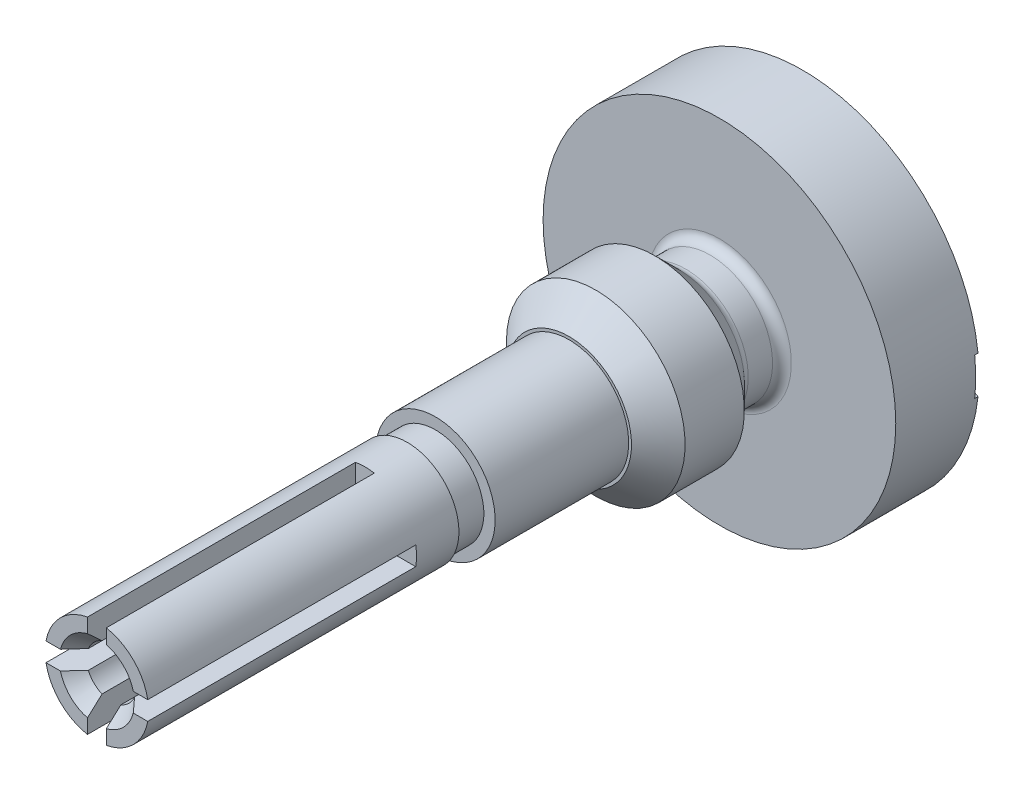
ISO-10303-21;
HEADER;
FILE_DESCRIPTION(('STEP AP214'),'2;1');
FILE_NAME('part.step','',(''),(''),'','','');
FILE_SCHEMA(('AUTOMOTIVE_DESIGN { 1 0 10303 214 1 1 1 1 }'));
ENDSEC;
DATA;
#1=APPLICATION_CONTEXT('core data for automotive mechanical design processes');
#2=APPLICATION_PROTOCOL_DEFINITION('international standard','automotive_design',2000,#1);
#3=PRODUCT_CONTEXT('',#1,'mechanical');
#4=PRODUCT('Part','Part','',(#3));
#5=PRODUCT_RELATED_PRODUCT_CATEGORY('part','',(#4));
#6=PRODUCT_DEFINITION_FORMATION('','',#4);
#7=PRODUCT_DEFINITION_CONTEXT('part definition',#1,'design');
#8=PRODUCT_DEFINITION('design','',#6,#7);
#9=PRODUCT_DEFINITION_SHAPE('','',#8);
#10=(LENGTH_UNIT() NAMED_UNIT(*) SI_UNIT(.MILLI.,.METRE.));
#11=(NAMED_UNIT(*) PLANE_ANGLE_UNIT() SI_UNIT($,.RADIAN.));
#12=(NAMED_UNIT(*) SI_UNIT($,.STERADIAN.) SOLID_ANGLE_UNIT());
#13=UNCERTAINTY_MEASURE_WITH_UNIT(LENGTH_MEASURE(1.E-05),#10,'distance_accuracy_value','');
#14=(GEOMETRIC_REPRESENTATION_CONTEXT(3) GLOBAL_UNCERTAINTY_ASSIGNED_CONTEXT((#13)) GLOBAL_UNIT_ASSIGNED_CONTEXT((#10,
#11,#12)) REPRESENTATION_CONTEXT('',''));
#15=CARTESIAN_POINT('',(0.,0.,0.));
#16=DIRECTION('',(0.,0.,1.));
#17=DIRECTION('',(1.,0.,0.));
#18=AXIS2_PLACEMENT_3D('',#15,#16,#17);
#19=CARTESIAN_POINT('',(0.,1.397,16.8148));
#20=DIRECTION('',(0.,0.,1.));
#21=DIRECTION('',(1.,0.,0.));
#22=AXIS2_PLACEMENT_3D('',#19,#20,#21);
#23=PLANE('',#22);
#24=DIRECTION('',(0.,-1.00000000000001,0.));
#25=VECTOR('',#24,1.);
#26=CARTESIAN_POINT('',(-0.253999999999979,4.76250000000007,16.8148));
#27=LINE('',#26,#25);
#28=CARTESIAN_POINT('',(-0.254,-0.983737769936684,16.8148));
#29=VERTEX_POINT('',#28);
#30=CARTESIAN_POINT('',(-0.254000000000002,-1.37371503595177,16.8148));
#31=VERTEX_POINT('',#30);
#32=EDGE_CURVE('E238',#29,#31,#27,.T.);
#33=ORIENTED_EDGE('',*,*,#32,.F.);
#34=CARTESIAN_POINT('',(0.,0.,16.8148));
#35=DIRECTION('',(0.,0.,1.));
#36=DIRECTION('',(1.,0.,0.));
#37=AXIS2_PLACEMENT_3D('',#34,#35,#36);
#38=CIRCLE('',#37,1.016);
#39=CARTESIAN_POINT('',(-0.983737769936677,-0.254000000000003,16.8148));
#40=VERTEX_POINT('',#39);
#41=EDGE_CURVE('E313',#40,#29,#38,.T.);
#42=ORIENTED_EDGE('',*,*,#41,.F.);
#43=DIRECTION('',(1.,0.,0.));
#44=VECTOR('',#43,1.);
#45=CARTESIAN_POINT('',(-4.76250000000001,-0.254000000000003,16.8148));
#46=LINE('',#45,#44);
#47=CARTESIAN_POINT('',(-1.37371503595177,-0.253999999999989,16.8148));
#48=VERTEX_POINT('',#47);
#49=EDGE_CURVE('E535',#48,#40,#46,.T.);
#50=ORIENTED_EDGE('',*,*,#49,.F.);
#51=CARTESIAN_POINT('',(0.,0.,16.8148));
#52=DIRECTION('',(0.,0.,-1.));
#53=DIRECTION('',(-1.,0.,0.));
#54=AXIS2_PLACEMENT_3D('',#51,#52,#53);
#55=CIRCLE('',#54,1.39699999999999);
#56=EDGE_CURVE('E259',#31,#48,#55,.T.);
#57=ORIENTED_EDGE('',*,*,#56,.F.);
#58=EDGE_LOOP('',(#33,#42,#50,#57));
#59=FACE_BOUND('',#58,.T.);
#60=ADVANCED_FACE('F30',(#59),#23,.T.);
#61=CARTESIAN_POINT('',(0.,0.,16.8148));
#62=DIRECTION('',(0.,0.,1.));
#63=DIRECTION('',(1.,0.,0.));
#64=AXIS2_PLACEMENT_3D('',#61,#62,#63);
#65=CONICAL_SURFACE('',#64,1.016,0.71558499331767);
#66=ORIENTED_EDGE('',*,*,#41,.T.);
#67=CARTESIAN_POINT('',(-0.254000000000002,-1.44149988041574,17.3298278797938));
#68=CARTESIAN_POINT('',(-0.254000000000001,-1.40120783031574,17.2841828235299));
#69=CARTESIAN_POINT('',(-0.254000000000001,-1.36088948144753,17.2385609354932));
#70=CARTESIAN_POINT('',(-0.254000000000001,-1.28015919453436,17.1473617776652));
#71=CARTESIAN_POINT('',(-0.254000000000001,-1.23974722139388,17.1017845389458));
#72=CARTESIAN_POINT('',(-0.254,-1.15843802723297,17.0102786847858));
#73=CARTESIAN_POINT('',(-0.254,-1.11753987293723,16.9643508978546));
#74=CARTESIAN_POINT('',(-0.254,-1.03562597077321,16.8726386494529));
#75=CARTESIAN_POINT('',(-0.254,-0.994610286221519,16.8268541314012));
#76=CARTESIAN_POINT('',(-0.253999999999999,-0.895594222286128,16.7167815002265));
#77=CARTESIAN_POINT('',(-0.253999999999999,-0.837501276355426,16.6525763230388));
#78=CARTESIAN_POINT('',(-0.253999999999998,-0.749811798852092,16.5566739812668));
#79=CARTESIAN_POINT('',(-0.253999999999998,-0.720465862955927,16.524747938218));
#80=CARTESIAN_POINT('',(-0.253999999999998,-0.66153984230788,16.4611223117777));
#81=CARTESIAN_POINT('',(-0.253999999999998,-0.631959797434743,16.4294226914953));
#82=CARTESIAN_POINT('',(-0.253999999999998,-0.572673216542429,16.3665807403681));
#83=CARTESIAN_POINT('',(-0.253999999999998,-0.542969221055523,16.3354360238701));
#84=CARTESIAN_POINT('',(-0.253999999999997,-0.483019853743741,16.2736327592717));
#85=CARTESIAN_POINT('',(-0.253999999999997,-0.452774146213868,16.24297453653));
#86=CARTESIAN_POINT('',(-0.253999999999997,-0.391529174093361,16.1825909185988));
#87=CARTESIAN_POINT('',(-0.253999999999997,-0.360532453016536,16.1528629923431));
#88=CARTESIAN_POINT('',(-0.253999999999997,-0.312917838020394,16.109528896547));
#89=CARTESIAN_POINT('',(-0.253999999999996,-0.29686844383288,16.0953009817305));
#90=CARTESIAN_POINT('',(-0.253999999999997,-0.264239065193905,16.0674703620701));
#91=CARTESIAN_POINT('',(-0.253999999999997,-0.247659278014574,16.0538674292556));
#92=CARTESIAN_POINT('',(-0.253999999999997,-0.219783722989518,16.0323100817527));
#93=CARTESIAN_POINT('',(-0.253999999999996,-0.208710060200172,16.0240699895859));
#94=CARTESIAN_POINT('',(-0.253999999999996,-0.186156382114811,16.0081462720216));
#95=CARTESIAN_POINT('',(-0.253999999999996,-0.174676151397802,16.0004629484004));
#96=CARTESIAN_POINT('',(-0.253999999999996,-0.151372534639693,15.9859877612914));
#97=CARTESIAN_POINT('',(-0.253999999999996,-0.139555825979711,15.9791853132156));
#98=CARTESIAN_POINT('',(-0.253999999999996,-0.115350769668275,15.9666978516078));
#99=CARTESIAN_POINT('',(-0.253999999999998,-0.102963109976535,15.961011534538));
#100=CARTESIAN_POINT('',(-0.253999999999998,-0.0771867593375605,15.9510851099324));
#101=CARTESIAN_POINT('',(-0.253999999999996,-0.0637795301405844,15.946891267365));
#102=CARTESIAN_POINT('',(-0.253999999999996,-0.0364794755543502,15.9408197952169));
#103=CARTESIAN_POINT('',(-0.253999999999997,-0.0225888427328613,15.9389328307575));
#104=CARTESIAN_POINT('',(-0.253999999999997,0.00538572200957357,15.9378407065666));
#105=CARTESIAN_POINT('',(-0.253999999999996,0.0194703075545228,15.9386511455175));
#106=CARTESIAN_POINT('',(-0.253999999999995,0.0472899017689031,15.9428121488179));
#107=CARTESIAN_POINT('',(-0.253999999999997,0.0610233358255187,15.9461725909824));
#108=CARTESIAN_POINT('',(-0.253999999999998,0.0946934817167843,15.9570554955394));
#109=CARTESIAN_POINT('',(-0.253999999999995,0.114209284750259,15.9658277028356));
#110=CARTESIAN_POINT('',(-0.253999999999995,0.151894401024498,15.9859327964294));
#111=CARTESIAN_POINT('',(-0.253999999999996,0.170056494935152,15.9972782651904));
#112=CARTESIAN_POINT('',(-0.253999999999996,0.20045268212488,16.0180654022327));
#113=CARTESIAN_POINT('',(-0.253999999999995,0.212930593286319,16.0271589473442));
#114=CARTESIAN_POINT('',(-0.253999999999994,0.237327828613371,16.045785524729));
#115=CARTESIAN_POINT('',(-0.253999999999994,0.249251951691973,16.0553122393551));
#116=CARTESIAN_POINT('',(-0.253999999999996,0.26102787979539,16.065005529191));
#117=B_SPLINE_CURVE_WITH_KNOTS('',3,(#67,#68,#69,#70,#71,#72,#73,#74,#75,#76,#77,#78,#79,#80,
#81,#82,#83,#84,#85,#86,#87,#88,#89,#90,#91,#92,#93,#94,#95,#96,#97,#98,#99,#100,#101,#102,#103,
#104,#105,#106,#107,#108,#109,#110,#111,#112,#113,#114,#115,#116),.UNSPECIFIED.,.F.,.F.,(4,2,2,
2,2,2,2,2,2,2,2,2,2,2,2,2,2,2,2,2,2,2,2,2,4),(0.,0.182653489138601,0.365392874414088,
0.549887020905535,0.73429562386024,0.994049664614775,1.12414147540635,1.25421158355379,
1.38332270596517,1.51251681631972,1.64132187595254,1.70565678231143,1.76996803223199,
1.81136516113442,1.85278456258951,1.89364781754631,1.93446306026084,1.9764514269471,
2.01826931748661,2.06032945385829,2.10255335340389,2.16637895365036,2.23052363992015,
2.27682800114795,2.32259551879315),.UNSPECIFIED.);
#118=CARTESIAN_POINT('',(-0.253999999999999,-0.623335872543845,16.4203386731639));
#119=VERTEX_POINT('',#118);
#120=EDGE_CURVE('E547',#29,#119,#117,.T.);
#121=ORIENTED_EDGE('',*,*,#120,.T.);
#122=CARTESIAN_POINT('',(0.,0.,16.4203386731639));
#123=DIRECTION('',(0.,0.,1.));
#124=DIRECTION('',(1.,0.,0.));
#125=AXIS2_PLACEMENT_3D('',#122,#123,#124);
#126=CIRCLE('',#125,0.6731);
#127=CARTESIAN_POINT('',(-0.623335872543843,-0.254000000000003,16.4203386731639));
#128=VERTEX_POINT('',#127);
#129=EDGE_CURVE('E318',#128,#119,#126,.T.);
#130=ORIENTED_EDGE('',*,*,#129,.F.);
#131=CARTESIAN_POINT('',(2.08034445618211,-0.254000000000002,18.0569599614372));
#132=CARTESIAN_POINT('',(2.01684669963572,-0.254000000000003,17.984455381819));
#133=CARTESIAN_POINT('',(1.95332737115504,-0.254000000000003,17.911969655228));
#134=CARTESIAN_POINT('',(1.82621740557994,-0.254000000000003,17.7670479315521));
#135=CARTESIAN_POINT('',(1.76262676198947,-0.254000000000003,17.6946119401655));
#136=CARTESIAN_POINT('',(1.63517868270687,-0.254000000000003,17.5496114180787));
#137=CARTESIAN_POINT('',(1.57132100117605,-0.254000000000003,17.477047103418));
#138=CARTESIAN_POINT('',(1.44348742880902,-0.254000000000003,17.3320351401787));
#139=CARTESIAN_POINT('',(1.37951155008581,-0.254000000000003,17.2595874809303));
#140=CARTESIAN_POINT('',(1.23949634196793,-0.254000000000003,17.1014392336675));
#141=CARTESIAN_POINT('',(1.16341952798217,-0.254000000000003,17.0157718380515));
#142=CARTESIAN_POINT('',(1.01080416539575,-0.254000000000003,16.8448007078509));
#143=CARTESIAN_POINT('',(0.934265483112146,-0.254000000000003,16.7594970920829));
#144=CARTESIAN_POINT('',(0.818876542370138,-0.254000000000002,16.6322341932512));
#145=CARTESIAN_POINT('',(0.780358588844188,-0.254000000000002,16.5899738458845));
#146=CARTESIAN_POINT('',(0.702980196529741,-0.254000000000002,16.5057576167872));
#147=CARTESIAN_POINT('',(0.66411971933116,-0.254000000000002,16.46380177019));
#148=CARTESIAN_POINT('',(0.585880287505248,-0.254000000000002,16.3804219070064));
#149=CARTESIAN_POINT('',(0.546501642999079,-0.254000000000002,16.3389975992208));
#150=CARTESIAN_POINT('',(0.46683132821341,-0.254000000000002,16.2570397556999));
#151=CARTESIAN_POINT('',(0.426539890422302,-0.254000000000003,16.2165059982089));
#152=CARTESIAN_POINT('',(0.366099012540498,-0.254000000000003,16.1584715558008));
#153=CARTESIAN_POINT('',(0.346673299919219,-0.254000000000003,16.1402209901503));
#154=CARTESIAN_POINT('',(0.307190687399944,-0.254000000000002,16.1043480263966));
#155=CARTESIAN_POINT('',(0.287132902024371,-0.254000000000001,16.0867265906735));
#156=CARTESIAN_POINT('',(0.246309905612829,-0.254000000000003,16.0527218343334));
#157=CARTESIAN_POINT('',(0.225553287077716,-0.254000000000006,16.0363282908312));
#158=CARTESIAN_POINT('',(0.182696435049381,-0.253999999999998,16.0054349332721));
#159=CARTESIAN_POINT('',(0.160600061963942,-0.253999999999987,15.9909300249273));
#160=CARTESIAN_POINT('',(0.120693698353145,-0.25399999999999,15.9690861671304));
#161=CARTESIAN_POINT('',(0.10337987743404,-0.253999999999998,15.9608739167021));
#162=CARTESIAN_POINT('',(0.0676212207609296,-0.254000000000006,15.9477848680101));
#163=CARTESIAN_POINT('',(0.0491891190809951,-0.254000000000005,15.942876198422));
#164=CARTESIAN_POINT('',(0.0169982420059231,-0.254000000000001,15.9384703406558));
#165=CARTESIAN_POINT('',(0.00340113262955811,-0.253999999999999,15.9378311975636));
#166=CARTESIAN_POINT('',(-0.0237023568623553,-0.254000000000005,15.9390738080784));
#167=CARTESIAN_POINT('',(-0.0372084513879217,-0.254000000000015,15.94096144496));
#168=CARTESIAN_POINT('',(-0.0679898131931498,-0.254000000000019,15.9478555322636));
#169=CARTESIAN_POINT('',(-0.0850760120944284,-0.254000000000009,15.9536714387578));
#170=CARTESIAN_POINT('',(-0.118189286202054,-0.253999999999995,15.9678120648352));
#171=CARTESIAN_POINT('',(-0.134211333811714,-0.25399999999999,15.9761477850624));
#172=CARTESIAN_POINT('',(-0.176208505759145,-0.253999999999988,16.0006696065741));
#173=CARTESIAN_POINT('',(-0.201330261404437,-0.253999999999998,16.0182757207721));
#174=CARTESIAN_POINT('',(-0.250044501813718,-0.254000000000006,16.05552124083));
#175=CARTESIAN_POINT('',(-0.273631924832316,-0.254000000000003,16.0751668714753));
#176=CARTESIAN_POINT('',(-0.319987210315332,-0.254000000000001,16.1156806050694));
#177=CARTESIAN_POINT('',(-0.342749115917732,-0.254000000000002,16.1365555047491));
#178=CARTESIAN_POINT('',(-0.387608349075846,-0.254000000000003,16.1789268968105));
#179=CARTESIAN_POINT('',(-0.409706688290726,-0.254000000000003,16.2004223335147));
#180=CARTESIAN_POINT('',(-0.474696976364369,-0.254000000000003,16.2648413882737));
#181=CARTESIAN_POINT('',(-0.517000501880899,-0.254000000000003,16.3083565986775));
#182=CARTESIAN_POINT('',(-0.600810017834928,-0.254000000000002,16.396150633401));
#183=CARTESIAN_POINT('',(-0.642315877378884,-0.254000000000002,16.4404295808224));
#184=CARTESIAN_POINT('',(-0.72488968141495,-0.254000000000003,16.529470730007));
#185=CARTESIAN_POINT('',(-0.765957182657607,-0.254000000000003,16.57423334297));
#186=CARTESIAN_POINT('',(-0.847788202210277,-0.254000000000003,16.6640286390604));
#187=CARTESIAN_POINT('',(-0.888551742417,-0.254000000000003,16.7090613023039));
#188=CARTESIAN_POINT('',(-1.01009891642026,-0.254000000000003,16.8439302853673));
#189=CARTESIAN_POINT('',(-1.09059043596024,-0.254000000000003,16.9340296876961));
#190=CARTESIAN_POINT('',(-1.25115241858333,-0.254000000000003,17.114546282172));
#191=CARTESIAN_POINT('',(-1.33122301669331,-0.254000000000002,17.2049633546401));
#192=CARTESIAN_POINT('',(-1.4669911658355,-0.254000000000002,17.3586774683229));
#193=CARTESIAN_POINT('',(-1.52274908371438,-0.254000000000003,17.4219211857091));
#194=CARTESIAN_POINT('',(-1.63418739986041,-0.254000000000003,17.5484881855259));
#195=CARTESIAN_POINT('',(-1.68986778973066,-0.254000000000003,17.6118114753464));
#196=CARTESIAN_POINT('',(-1.80137758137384,-0.254000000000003,17.7387517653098));
#197=CARTESIAN_POINT('',(-1.85720674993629,-0.254000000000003,17.8023689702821));
#198=CARTESIAN_POINT('',(-1.96881115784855,-0.254000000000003,17.9296390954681));
#199=CARTESIAN_POINT('',(-2.02458640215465,-0.254000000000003,17.9932920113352));
#200=CARTESIAN_POINT('',(-2.0803444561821,-0.254000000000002,18.0569599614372));
#201=B_SPLINE_CURVE_WITH_KNOTS('',3,(#131,#132,#133,#134,#135,#136,#137,#138,#139,#140,#141,
#142,#143,#144,#145,#146,#147,#148,#149,#150,#151,#152,#153,#154,#155,#156,#157,#158,#159,#160,
#161,#162,#163,#164,#165,#166,#167,#168,#169,#170,#171,#172,#173,#174,#175,#176,#177,#178,#179,
#180,#181,#182,#183,#184,#185,#186,#187,#188,#189,#190,#191,#192,#193,#194,#195,#196,#197,#198,
#199,#200),.UNSPECIFIED.,.F.,.F.,(4,2,2,2,2,2,2,2,2,2,2,2,2,2,2,2,2,2,2,2,2,2,2,2,2,2,2,2,2,2,2,
2,2,2,4),(0.,0.289136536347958,0.578301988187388,0.868285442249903,1.15824066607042,
1.50195423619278,1.84577258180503,2.01731220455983,2.18887131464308,2.36033203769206,
2.53174957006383,2.61170352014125,2.69177494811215,2.77108116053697,2.85016881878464,
2.90746835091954,2.96420684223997,3.00480978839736,3.04550743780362,3.09932932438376,
3.15338965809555,3.24516062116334,3.33722040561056,3.42984838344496,3.52232712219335,
3.70436716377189,3.88643682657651,4.06867584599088,4.25090160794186,4.61335004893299,
4.97567409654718,5.22861353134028,5.48157850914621,5.73550052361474,5.98939642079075),.UNSPECIFIED.);
#202=EDGE_CURVE('E477',#128,#40,#201,.T.);
#203=ORIENTED_EDGE('',*,*,#202,.T.);
#204=EDGE_LOOP('',(#66,#121,#130,#203));
#205=FACE_BOUND('',#204,.T.);
#206=ADVANCED_FACE('F641',(#205),#65,.F.);
#207=CARTESIAN_POINT('',(-0.253999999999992,1.37371503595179,16.8148));
#208=VERTEX_POINT('',#207);
#209=CARTESIAN_POINT('',(-0.253999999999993,0.983737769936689,16.8148));
#210=VERTEX_POINT('',#209);
#211=EDGE_CURVE('E583',#208,#210,#27,.T.);
#212=ORIENTED_EDGE('',*,*,#211,.F.);
#213=CARTESIAN_POINT('',(-1.37371503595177,0.254000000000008,16.8148));
#214=VERTEX_POINT('',#213);
#215=EDGE_CURVE('E256',#214,#208,#55,.T.);
#216=ORIENTED_EDGE('',*,*,#215,.F.);
#217=DIRECTION('',(1.,0.,0.));
#218=VECTOR('',#217,1.);
#219=CARTESIAN_POINT('',(-4.76250000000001,0.254000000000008,16.8148));
#220=LINE('',#219,#218);
#221=CARTESIAN_POINT('',(-0.983737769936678,0.253999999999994,16.8148));
#222=VERTEX_POINT('',#221);
#223=EDGE_CURVE('E527',#214,#222,#220,.T.);
#224=ORIENTED_EDGE('',*,*,#223,.T.);
#225=EDGE_CURVE('E311',#210,#222,#38,.T.);
#226=ORIENTED_EDGE('',*,*,#225,.F.);
#227=EDGE_LOOP('',(#212,#216,#224,#226));
#228=FACE_BOUND('',#227,.T.);
#229=ADVANCED_FACE('F533',(#228),#23,.T.);
#230=CARTESIAN_POINT('',(-0.253999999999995,0.623335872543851,16.4203386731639));
#231=VERTEX_POINT('',#230);
#232=CARTESIAN_POINT('',(-0.623335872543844,0.254000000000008,16.4203386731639));
#233=VERTEX_POINT('',#232);
#234=EDGE_CURVE('E317',#231,#233,#126,.T.);
#235=ORIENTED_EDGE('',*,*,#234,.F.);
#236=CARTESIAN_POINT('',(-0.253999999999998,-0.261027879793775,16.0650055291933));
#237=CARTESIAN_POINT('',(-0.253999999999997,-0.247167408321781,16.0536148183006));
#238=CARTESIAN_POINT('',(-0.253999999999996,-0.233105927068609,16.0424307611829));
#239=CARTESIAN_POINT('',(-0.253999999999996,-0.204170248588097,16.0206886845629));
#240=CARTESIAN_POINT('',(-0.253999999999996,-0.189286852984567,16.0101430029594));
#241=CARTESIAN_POINT('',(-0.253999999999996,-0.157888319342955,15.9897301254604));
#242=CARTESIAN_POINT('',(-0.253999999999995,-0.141328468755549,15.9799302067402));
#243=CARTESIAN_POINT('',(-0.253999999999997,-0.107107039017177,15.962648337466));
#244=CARTESIAN_POINT('',(-0.253999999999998,-0.0894541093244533,15.9551504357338));
#245=CARTESIAN_POINT('',(-0.253999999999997,-0.0639938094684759,15.9472442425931));
#246=CARTESIAN_POINT('',(-0.253999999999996,-0.0566688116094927,15.945287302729));
#247=CARTESIAN_POINT('',(-0.253999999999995,-0.0418697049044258,15.9420437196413));
#248=CARTESIAN_POINT('',(-0.253999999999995,-0.0343955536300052,15.9407572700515));
#249=CARTESIAN_POINT('',(-0.253999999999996,-0.0120693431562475,15.9380647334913));
#250=CARTESIAN_POINT('',(-0.253999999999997,0.00293366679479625,15.937744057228));
#251=CARTESIAN_POINT('',(-0.253999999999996,0.0327034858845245,15.940130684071));
#252=CARTESIAN_POINT('',(-0.253999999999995,0.0474697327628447,15.9428443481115));
#253=CARTESIAN_POINT('',(-0.253999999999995,0.0764200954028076,15.95072175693));
#254=CARTESIAN_POINT('',(-0.253999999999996,0.0905986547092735,15.95590479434));
#255=CARTESIAN_POINT('',(-0.253999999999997,0.120830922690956,15.9691212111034));
#256=CARTESIAN_POINT('',(-0.253999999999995,0.136723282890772,15.9775104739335));
#257=CARTESIAN_POINT('',(-0.253999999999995,0.167636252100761,15.9957870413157));
#258=CARTESIAN_POINT('',(-0.253999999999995,0.182654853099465,16.0056776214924));
#259=CARTESIAN_POINT('',(-0.253999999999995,0.212105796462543,16.0264639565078));
#260=CARTESIAN_POINT('',(-0.253999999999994,0.226534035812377,16.037365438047));
#261=CARTESIAN_POINT('',(-0.253999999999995,0.254868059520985,16.0597893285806));
#262=CARTESIAN_POINT('',(-0.253999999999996,0.268774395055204,16.0713110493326));
#263=CARTESIAN_POINT('',(-0.253999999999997,0.313159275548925,16.1092651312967));
#264=CARTESIAN_POINT('',(-0.253999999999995,0.342905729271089,16.1365476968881));
#265=CARTESIAN_POINT('',(-0.253999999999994,0.401410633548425,16.1921578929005));
#266=CARTESIAN_POINT('',(-0.253999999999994,0.430168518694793,16.2204861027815));
#267=CARTESIAN_POINT('',(-0.253999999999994,0.487119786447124,16.2777976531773));
#268=CARTESIAN_POINT('',(-0.253999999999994,0.515312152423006,16.3067820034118));
#269=CARTESIAN_POINT('',(-0.253999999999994,0.571291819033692,16.3651228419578));
#270=CARTESIAN_POINT('',(-0.253999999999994,0.599079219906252,16.3944792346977));
#271=CARTESIAN_POINT('',(-0.253999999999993,0.681862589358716,16.4827290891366));
#272=CARTESIAN_POINT('',(-0.253999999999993,0.73646368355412,16.5419924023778));
#273=CARTESIAN_POINT('',(-0.253999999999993,0.845077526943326,16.6609648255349));
#274=CARTESIAN_POINT('',(-0.253999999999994,0.899090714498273,16.7206735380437));
#275=CARTESIAN_POINT('',(-0.253999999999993,0.993894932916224,16.8260550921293));
#276=CARTESIAN_POINT('',(-0.253999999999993,1.034755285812,16.8716655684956));
#277=CARTESIAN_POINT('',(-0.253999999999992,1.11635105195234,16.9630181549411));
#278=CARTESIAN_POINT('',(-0.253999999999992,1.15708643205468,17.0087602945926));
#279=CARTESIAN_POINT('',(-0.253999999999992,1.23848228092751,17.1003583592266));
#280=CARTESIAN_POINT('',(-0.253999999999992,1.27914269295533,17.1462143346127));
#281=CARTESIAN_POINT('',(-0.253999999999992,1.36037751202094,17.2379817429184));
#282=CARTESIAN_POINT('',(-0.253999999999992,1.40095193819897,17.2838931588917));
#283=CARTESIAN_POINT('',(-0.253999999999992,1.44149988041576,17.3298278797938));
#284=B_SPLINE_CURVE_WITH_KNOTS('',3,(#236,#237,#238,#239,#240,#241,#242,#243,#244,#245,#246,
#247,#248,#249,#250,#251,#252,#253,#254,#255,#256,#257,#258,#259,#260,#261,#262,#263,#264,#265,
#266,#267,#268,#269,#270,#271,#272,#273,#274,#275,#276,#277,#278,#279,#280,#281,#282,#283),
.UNSPECIFIED.,.F.,.F.,(4,2,2,2,2,2,2,2,2,2,2,2,2,2,2,2,2,2,2,2,2,2,2,4),(0.,0.0538568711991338,
0.108545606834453,0.166184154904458,0.223413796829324,0.246131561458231,0.268855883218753,
0.31353691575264,0.358311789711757,0.40344236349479,0.457221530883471,0.511119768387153,
0.565344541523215,0.61951033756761,0.740535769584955,0.861629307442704,0.982923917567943,
1.10418797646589,1.34592462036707,1.58746660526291,1.77117505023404,1.95492860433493,
2.13878811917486,2.32260116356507),.UNSPECIFIED.);
#285=EDGE_CURVE('E554',#231,#210,#284,.T.);
#286=ORIENTED_EDGE('',*,*,#285,.T.);
#287=ORIENTED_EDGE('',*,*,#225,.T.);
#288=CARTESIAN_POINT('',(-2.08034445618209,0.254000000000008,18.0569599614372));
#289=CARTESIAN_POINT('',(-2.0168466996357,0.254000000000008,17.984455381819));
#290=CARTESIAN_POINT('',(-1.95332737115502,0.254000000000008,17.911969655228));
#291=CARTESIAN_POINT('',(-1.82621740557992,0.254000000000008,17.7670479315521));
#292=CARTESIAN_POINT('',(-1.76262676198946,0.254000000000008,17.6946119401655));
#293=CARTESIAN_POINT('',(-1.63517868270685,0.254000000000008,17.5496114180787));
#294=CARTESIAN_POINT('',(-1.57132100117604,0.254000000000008,17.477047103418));
#295=CARTESIAN_POINT('',(-1.44348742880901,0.254000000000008,17.3320351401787));
#296=CARTESIAN_POINT('',(-1.3795115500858,0.254000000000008,17.2595874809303));
#297=CARTESIAN_POINT('',(-1.23949634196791,0.254000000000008,17.1014392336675));
#298=CARTESIAN_POINT('',(-1.16341952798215,0.254000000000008,17.0157718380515));
#299=CARTESIAN_POINT('',(-1.01080416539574,0.254000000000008,16.8448007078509));
#300=CARTESIAN_POINT('',(-0.934265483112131,0.254000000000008,16.7594970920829));
#301=CARTESIAN_POINT('',(-0.818876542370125,0.254000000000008,16.6322341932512));
#302=CARTESIAN_POINT('',(-0.780358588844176,0.254000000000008,16.5899738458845));
#303=CARTESIAN_POINT('',(-0.702980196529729,0.254000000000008,16.5057576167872));
#304=CARTESIAN_POINT('',(-0.664119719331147,0.254000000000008,16.46380177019));
#305=CARTESIAN_POINT('',(-0.585880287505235,0.254000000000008,16.3804219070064));
#306=CARTESIAN_POINT('',(-0.546501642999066,0.254000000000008,16.3389975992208));
#307=CARTESIAN_POINT('',(-0.466831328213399,0.254000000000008,16.2570397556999));
#308=CARTESIAN_POINT('',(-0.426539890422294,0.254000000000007,16.2165059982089));
#309=CARTESIAN_POINT('',(-0.366099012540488,0.254000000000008,16.1584715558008));
#310=CARTESIAN_POINT('',(-0.346673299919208,0.254000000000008,16.1402209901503));
#311=CARTESIAN_POINT('',(-0.307190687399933,0.254000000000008,16.1043480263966));
#312=CARTESIAN_POINT('',(-0.287132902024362,0.254000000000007,16.0867265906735));
#313=CARTESIAN_POINT('',(-0.246309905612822,0.254000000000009,16.0527218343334));
#314=CARTESIAN_POINT('',(-0.22555328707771,0.254000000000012,16.0363282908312));
#315=CARTESIAN_POINT('',(-0.182696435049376,0.254000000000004,16.0054349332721));
#316=CARTESIAN_POINT('',(-0.160600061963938,0.253999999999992,15.9909300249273));
#317=CARTESIAN_POINT('',(-0.12069369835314,0.253999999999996,15.9690861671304));
#318=CARTESIAN_POINT('',(-0.103379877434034,0.254000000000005,15.9608739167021));
#319=CARTESIAN_POINT('',(-0.067621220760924,0.254000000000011,15.9477848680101));
#320=CARTESIAN_POINT('',(-0.04918911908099,0.254000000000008,15.942876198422));
#321=CARTESIAN_POINT('',(-0.0169982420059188,0.254000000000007,15.9384703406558));
#322=CARTESIAN_POINT('',(-0.00340113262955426,0.254000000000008,15.9378311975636));
#323=CARTESIAN_POINT('',(0.0237023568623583,0.254000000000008,15.9390738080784));
#324=CARTESIAN_POINT('',(0.0372084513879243,0.254000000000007,15.94096144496));
#325=CARTESIAN_POINT('',(0.0679898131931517,0.254000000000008,15.9478555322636));
#326=CARTESIAN_POINT('',(0.0850760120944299,0.254000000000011,15.9536714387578));
#327=CARTESIAN_POINT('',(0.118189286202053,0.254000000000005,15.9678120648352));
#328=CARTESIAN_POINT('',(0.134211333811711,0.253999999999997,15.9761477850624));
#329=CARTESIAN_POINT('',(0.176208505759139,0.25399999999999,16.0006696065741));
#330=CARTESIAN_POINT('',(0.201330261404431,0.254000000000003,16.0182757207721));
#331=CARTESIAN_POINT('',(0.250044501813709,0.254000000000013,16.05552124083));
#332=CARTESIAN_POINT('',(0.273631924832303,0.254000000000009,16.0751668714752));
#333=CARTESIAN_POINT('',(0.319987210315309,0.254000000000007,16.1156806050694));
#334=CARTESIAN_POINT('',(0.342749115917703,0.254000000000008,16.1365555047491));
#335=CARTESIAN_POINT('',(0.387608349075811,0.254000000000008,16.1789268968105));
#336=CARTESIAN_POINT('',(0.40970668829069,0.254000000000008,16.2004223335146));
#337=CARTESIAN_POINT('',(0.474696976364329,0.254000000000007,16.2648413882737));
#338=CARTESIAN_POINT('',(0.517000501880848,0.254000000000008,16.3083565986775));
#339=CARTESIAN_POINT('',(0.600810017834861,0.254000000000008,16.3961506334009));
#340=CARTESIAN_POINT('',(0.642315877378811,0.254000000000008,16.4404295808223));
#341=CARTESIAN_POINT('',(0.724889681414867,0.254000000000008,16.5294707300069));
#342=CARTESIAN_POINT('',(0.76595718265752,0.254000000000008,16.5742333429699));
#343=CARTESIAN_POINT('',(0.847788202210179,0.254000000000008,16.6640286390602));
#344=CARTESIAN_POINT('',(0.888551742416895,0.254000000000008,16.7090613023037));
#345=CARTESIAN_POINT('',(1.01009891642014,0.254000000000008,16.8439302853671));
#346=CARTESIAN_POINT('',(1.0905904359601,0.254000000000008,16.9340296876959));
#347=CARTESIAN_POINT('',(1.25115241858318,0.254000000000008,17.1145462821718));
#348=CARTESIAN_POINT('',(1.33122301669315,0.254000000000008,17.2049633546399));
#349=CARTESIAN_POINT('',(1.46699116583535,0.254000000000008,17.3586774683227));
#350=CARTESIAN_POINT('',(1.52274908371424,0.254000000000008,17.4219211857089));
#351=CARTESIAN_POINT('',(1.63418739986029,0.254000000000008,17.5484881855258));
#352=CARTESIAN_POINT('',(1.68986778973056,0.254000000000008,17.6118114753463));
#353=CARTESIAN_POINT('',(1.80137758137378,0.254000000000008,17.7387517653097));
#354=CARTESIAN_POINT('',(1.85720674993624,0.254000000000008,17.802368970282));
#355=CARTESIAN_POINT('',(1.96881115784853,0.254000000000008,17.929639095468));
#356=CARTESIAN_POINT('',(2.02458640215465,0.254000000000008,17.9932920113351));
#357=CARTESIAN_POINT('',(2.08034445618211,0.254000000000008,18.0569599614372));
#358=B_SPLINE_CURVE_WITH_KNOTS('',3,(#288,#289,#290,#291,#292,#293,#294,#295,#296,#297,#298,
#299,#300,#301,#302,#303,#304,#305,#306,#307,#308,#309,#310,#311,#312,#313,#314,#315,#316,#317,
#318,#319,#320,#321,#322,#323,#324,#325,#326,#327,#328,#329,#330,#331,#332,#333,#334,#335,#336,
#337,#338,#339,#340,#341,#342,#343,#344,#345,#346,#347,#348,#349,#350,#351,#352,#353,#354,#355,
#356,#357),.UNSPECIFIED.,.F.,.F.,(4,2,2,2,2,2,2,2,2,2,2,2,2,2,2,2,2,2,2,2,2,2,2,2,2,2,2,2,2,2,2,
2,2,2,4),(0.,0.289136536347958,0.578301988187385,0.8682854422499,1.15824066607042,
1.50195423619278,1.84577258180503,2.01731220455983,2.18887131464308,2.36033203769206,
2.53174957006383,2.61170352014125,2.69177494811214,2.77108116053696,2.85016881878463,
2.90746835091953,2.96420684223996,3.00480978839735,3.0455074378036,3.09932932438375,
3.15338965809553,3.24516062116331,3.33722040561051,3.4298483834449,3.52232712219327,
3.70436716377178,3.88643682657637,4.06867584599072,4.25090160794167,4.61335004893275,
4.97567409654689,5.22861353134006,5.48157850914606,5.73550052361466,5.98939642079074),.UNSPECIFIED.);
#359=EDGE_CURVE('E512',#222,#233,#358,.T.);
#360=ORIENTED_EDGE('',*,*,#359,.T.);
#361=EDGE_LOOP('',(#235,#286,#287,#360));
#362=FACE_BOUND('',#361,.T.);
#363=ADVANCED_FACE('F522',(#362),#65,.F.);
#364=DIRECTION('',(0.,-1.00000000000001,0.));
#365=VECTOR('',#364,1.);
#366=CARTESIAN_POINT('',(0.254000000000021,4.76250000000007,16.8148));
#367=LINE('',#366,#365);
#368=CARTESIAN_POINT('',(0.254000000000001,-0.983737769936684,16.8148));
#369=VERTEX_POINT('',#368);
#370=CARTESIAN_POINT('',(0.254,-1.37371503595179,16.8148));
#371=VERTEX_POINT('',#370);
#372=EDGE_CURVE('E239',#369,#371,#367,.T.);
#373=ORIENTED_EDGE('',*,*,#372,.T.);
#374=CARTESIAN_POINT('',(1.37371503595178,-0.253999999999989,16.8148));
#375=VERTEX_POINT('',#374);
#376=EDGE_CURVE('E257',#375,#371,#55,.T.);
#377=ORIENTED_EDGE('',*,*,#376,.F.);
#378=CARTESIAN_POINT('',(0.983737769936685,-0.254000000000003,16.8148));
#379=VERTEX_POINT('',#378);
#380=EDGE_CURVE('E534',#379,#375,#46,.T.);
#381=ORIENTED_EDGE('',*,*,#380,.F.);
#382=EDGE_CURVE('E312',#369,#379,#38,.T.);
#383=ORIENTED_EDGE('',*,*,#382,.F.);
#384=EDGE_LOOP('',(#373,#377,#381,#383));
#385=FACE_BOUND('',#384,.T.);
#386=ADVANCED_FACE('F628',(#385),#23,.T.);
#387=CARTESIAN_POINT('',(0.254000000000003,-0.623335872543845,16.4203386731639));
#388=VERTEX_POINT('',#387);
#389=CARTESIAN_POINT('',(0.623335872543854,-0.254000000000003,16.4203386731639));
#390=VERTEX_POINT('',#389);
#391=EDGE_CURVE('E322',#388,#390,#126,.T.);
#392=ORIENTED_EDGE('',*,*,#391,.F.);
#393=CARTESIAN_POINT('',(0.254000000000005,0.261027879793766,16.0650055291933));
#394=CARTESIAN_POINT('',(0.254000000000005,0.247167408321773,16.0536148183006));
#395=CARTESIAN_POINT('',(0.254000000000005,0.233105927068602,16.0424307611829));
#396=CARTESIAN_POINT('',(0.254000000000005,0.204170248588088,16.0206886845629));
#397=CARTESIAN_POINT('',(0.254000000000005,0.189286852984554,16.0101430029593));
#398=CARTESIAN_POINT('',(0.254000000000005,0.157888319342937,15.9897301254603));
#399=CARTESIAN_POINT('',(0.254000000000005,0.14132846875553,15.9799302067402));
#400=CARTESIAN_POINT('',(0.254000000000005,0.10710703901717,15.962648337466));
#401=CARTESIAN_POINT('',(0.254000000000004,0.0894541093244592,15.9551504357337));
#402=CARTESIAN_POINT('',(0.254000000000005,0.0639938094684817,15.9472442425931));
#403=CARTESIAN_POINT('',(0.254000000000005,0.0566688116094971,15.945287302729));
#404=CARTESIAN_POINT('',(0.254000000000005,0.0418697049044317,15.9420437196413));
#405=CARTESIAN_POINT('',(0.254000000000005,0.0343955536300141,15.9407572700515));
#406=CARTESIAN_POINT('',(0.254000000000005,0.0120693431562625,15.9380647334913));
#407=CARTESIAN_POINT('',(0.254000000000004,-0.00293366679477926,15.937744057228));
#408=CARTESIAN_POINT('',(0.254000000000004,-0.0327034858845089,15.940130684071));
#409=CARTESIAN_POINT('',(0.254000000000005,-0.0474697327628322,15.9428443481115));
#410=CARTESIAN_POINT('',(0.254000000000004,-0.0764200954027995,15.95072175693));
#411=CARTESIAN_POINT('',(0.254000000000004,-0.0905986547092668,15.95590479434));
#412=CARTESIAN_POINT('',(0.254000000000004,-0.120830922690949,15.9691212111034));
#413=CARTESIAN_POINT('',(0.254000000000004,-0.136723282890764,15.9775104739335));
#414=CARTESIAN_POINT('',(0.254000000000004,-0.167636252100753,15.9957870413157));
#415=CARTESIAN_POINT('',(0.254000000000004,-0.182654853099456,16.0056776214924));
#416=CARTESIAN_POINT('',(0.254000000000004,-0.212105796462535,16.0264639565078));
#417=CARTESIAN_POINT('',(0.254000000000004,-0.226534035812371,16.037365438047));
#418=CARTESIAN_POINT('',(0.254000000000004,-0.254868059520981,16.0597893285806));
#419=CARTESIAN_POINT('',(0.254000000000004,-0.268774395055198,16.0713110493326));
#420=CARTESIAN_POINT('',(0.254000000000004,-0.31315927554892,16.1092651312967));
#421=CARTESIAN_POINT('',(0.254000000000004,-0.342905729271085,16.1365476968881));
#422=CARTESIAN_POINT('',(0.254000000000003,-0.401410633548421,16.1921578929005));
#423=CARTESIAN_POINT('',(0.254000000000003,-0.430168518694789,16.2204861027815));
#424=CARTESIAN_POINT('',(0.254000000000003,-0.487119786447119,16.2777976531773));
#425=CARTESIAN_POINT('',(0.254000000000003,-0.515312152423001,16.3067820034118));
#426=CARTESIAN_POINT('',(0.254000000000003,-0.571291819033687,16.3651228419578));
#427=CARTESIAN_POINT('',(0.254000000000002,-0.599079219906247,16.3944792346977));
#428=CARTESIAN_POINT('',(0.254000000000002,-0.68186258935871,16.4827290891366));
#429=CARTESIAN_POINT('',(0.254000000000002,-0.736463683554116,16.5419924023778));
#430=CARTESIAN_POINT('',(0.254000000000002,-0.845077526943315,16.6609648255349));
#431=CARTESIAN_POINT('',(0.254000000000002,-0.899090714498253,16.7206735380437));
#432=CARTESIAN_POINT('',(0.254000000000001,-0.993894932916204,16.8260550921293));
#433=CARTESIAN_POINT('',(0.254000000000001,-1.03475528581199,16.8716655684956));
#434=CARTESIAN_POINT('',(0.254,-1.11635105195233,16.9630181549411));
#435=CARTESIAN_POINT('',(0.254,-1.15708643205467,17.0087602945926));
#436=CARTESIAN_POINT('',(0.254,-1.2384822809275,17.1003583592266));
#437=CARTESIAN_POINT('',(0.254,-1.27914269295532,17.1462143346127));
#438=CARTESIAN_POINT('',(0.254,-1.36037751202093,17.2379817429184));
#439=CARTESIAN_POINT('',(0.254,-1.40095193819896,17.2838931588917));
#440=CARTESIAN_POINT('',(0.254,-1.44149988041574,17.3298278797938));
#441=B_SPLINE_CURVE_WITH_KNOTS('',3,(#393,#394,#395,#396,#397,#398,#399,#400,#401,#402,#403,
#404,#405,#406,#407,#408,#409,#410,#411,#412,#413,#414,#415,#416,#417,#418,#419,#420,#421,#422,
#423,#424,#425,#426,#427,#428,#429,#430,#431,#432,#433,#434,#435,#436,#437,#438,#439,#440),
.UNSPECIFIED.,.F.,.F.,(4,2,2,2,2,2,2,2,2,2,2,2,2,2,2,2,2,2,2,2,2,2,2,4),(0.,0.0538568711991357,
0.108545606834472,0.166184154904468,0.223413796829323,0.246131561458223,0.26885588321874,
0.313536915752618,0.358311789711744,0.403442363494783,0.457221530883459,0.511119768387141,
0.565344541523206,0.619510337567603,0.740535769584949,0.861629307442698,0.982923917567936,
1.10418797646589,1.34592462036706,1.58746660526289,1.77117505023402,1.95492860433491,
2.13878811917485,2.32260116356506),.UNSPECIFIED.);
#442=EDGE_CURVE('E53',#388,#369,#441,.T.);
#443=ORIENTED_EDGE('',*,*,#442,.T.);
#444=ORIENTED_EDGE('',*,*,#382,.T.);
#445=EDGE_CURVE('E474',#379,#390,#201,.T.);
#446=ORIENTED_EDGE('',*,*,#445,.T.);
#447=EDGE_LOOP('',(#392,#443,#444,#446));
#448=FACE_BOUND('',#447,.T.);
#449=ADVANCED_FACE('F631',(#448),#65,.F.);
#450=CARTESIAN_POINT('',(0.,0.,9.52500000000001));
#451=DIRECTION('',(0.,0.,-1.));
#452=DIRECTION('',(0.,1.00000000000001,0.));
#453=AXIS2_PLACEMENT_3D('',#450,#451,#452);
#454=SPHERICAL_SURFACE('',#453,12.7);
#455=CARTESIAN_POINT('',(0.,0.507999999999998,9.52500000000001));
#456=DIRECTION('',(0.,1.00000000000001,0.));
#457=DIRECTION('',(0.,0.,1.));
#458=AXIS2_PLACEMENT_3D('',#455,#456,#457);
#459=CIRCLE('',#458,12.6898359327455);
#460=CARTESIAN_POINT('',(-4.73532915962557,0.50800000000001,-2.24821509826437));
#461=VERTEX_POINT('',#460);
#462=CARTESIAN_POINT('',(-1.27781891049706,0.50800000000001,-3.1003362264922));
#463=VERTEX_POINT('',#462);
#464=EDGE_CURVE('E340',#461,#463,#459,.F.);
#465=ORIENTED_EDGE('',*,*,#464,.F.);
#466=CARTESIAN_POINT('',(0.,0.,-2.24821509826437));
#467=DIRECTION('',(0.,0.,-1.));
#468=DIRECTION('',(-1.,0.,0.));
#469=AXIS2_PLACEMENT_3D('',#466,#467,#468);
#470=CIRCLE('',#469,4.7625);
#471=CARTESIAN_POINT('',(4.73532915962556,0.507999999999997,-2.24821509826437));
#472=VERTEX_POINT('',#471);
#473=EDGE_CURVE('E415',#461,#472,#470,.T.);
#474=ORIENTED_EDGE('',*,*,#473,.T.);
#475=CARTESIAN_POINT('',(1.27781891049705,0.508000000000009,-3.1003362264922));
#476=VERTEX_POINT('',#475);
#477=EDGE_CURVE('E345',#476,#472,#459,.F.);
#478=ORIENTED_EDGE('',*,*,#477,.F.);
#479=CARTESIAN_POINT('',(0.,0.,-3.1003362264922));
#480=DIRECTION('',(0.,0.,1.));
#481=DIRECTION('',(1.,0.,0.));
#482=AXIS2_PLACEMENT_3D('',#479,#480,#481);
#483=CIRCLE('',#482,1.37509460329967);
#484=EDGE_CURVE('E327',#463,#476,#483,.F.);
#485=ORIENTED_EDGE('',*,*,#484,.F.);
#486=EDGE_LOOP('',(#465,#474,#478,#485));
#487=FACE_BOUND('',#486,.T.);
#488=ADVANCED_FACE('F659',(#487),#454,.T.);
#489=CARTESIAN_POINT('',(0.,0.,-2.92099999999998));
#490=DIRECTION('',(0.,0.,-1.));
#491=DIRECTION('',(-1.,0.,0.));
#492=AXIS2_PLACEMENT_3D('',#489,#490,#491);
#493=CONICAL_SURFACE('',#492,1.2192,0.71558499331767);
#494=ORIENTED_EDGE('',*,*,#484,.T.);
#495=CARTESIAN_POINT('',(2.76648222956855,0.507999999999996,-4.7541543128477));
#496=CARTESIAN_POINT('',(2.68949891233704,0.508000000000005,-4.6670563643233));
#497=CARTESIAN_POINT('',(2.61246139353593,0.508000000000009,-4.5800062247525));
#498=CARTESIAN_POINT('',(2.45818983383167,0.508000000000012,-4.40599310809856));
#499=CARTESIAN_POINT('',(2.38095570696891,0.508000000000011,-4.31903020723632));
#500=CARTESIAN_POINT('',(2.22541398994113,0.50800000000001,-4.14429786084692));
#501=CARTESIAN_POINT('',(2.14710414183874,0.50800000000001,-4.056530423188));
#502=CARTESIAN_POINT('',(1.99024717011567,0.50800000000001,-3.88129550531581));
#503=CARTESIAN_POINT('',(1.91170020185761,0.50800000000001,-3.79382788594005));
#504=CARTESIAN_POINT('',(1.72096571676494,0.50800000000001,-3.58237054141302));
#505=CARTESIAN_POINT('',(1.60858103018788,0.50800000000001,-3.45855784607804));
#506=CARTESIAN_POINT('',(1.43884152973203,0.50800000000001,-3.27368029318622));
#507=CARTESIAN_POINT('',(1.38201120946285,0.50800000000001,-3.21213428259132));
#508=CARTESIAN_POINT('',(1.26786085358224,0.50800000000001,-3.08951927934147));
#509=CARTESIAN_POINT('',(1.21054091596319,0.50800000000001,-3.02845019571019));
#510=CARTESIAN_POINT('',(1.0956750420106,0.50800000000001,-2.90753124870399));
#511=CARTESIAN_POINT('',(1.03813541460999,0.50800000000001,-2.84767539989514));
#512=CARTESIAN_POINT('',(0.921924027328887,0.50800000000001,-2.72897361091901));
#513=CARTESIAN_POINT('',(0.863251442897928,0.508000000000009,-2.67012847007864));
#514=CARTESIAN_POINT('',(0.773997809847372,0.50800000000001,-2.58334810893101));
#515=CARTESIAN_POINT('',(0.74409321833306,0.50800000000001,-2.55471862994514));
#516=CARTESIAN_POINT('',(0.683687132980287,0.508000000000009,-2.49809810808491));
#517=CARTESIAN_POINT('',(0.653185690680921,0.508000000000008,-2.47010701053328));
#518=CARTESIAN_POINT('',(0.59141446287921,0.508000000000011,-2.41506021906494));
#519=CARTESIAN_POINT('',(0.560145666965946,0.508000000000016,-2.38800341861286));
#520=CARTESIAN_POINT('',(0.496505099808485,0.508000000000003,-2.33522564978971));
#521=CARTESIAN_POINT('',(0.464133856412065,0.507999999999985,-2.30950405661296));
#522=CARTESIAN_POINT('',(0.421028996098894,0.508000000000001,-2.27742885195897));
#523=CARTESIAN_POINT('',(0.411006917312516,0.508000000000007,-2.27011840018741));
#524=CARTESIAN_POINT('',(0.390802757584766,0.508000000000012,-2.25571944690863));
#525=CARTESIAN_POINT('',(0.380620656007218,0.50800000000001,-2.24863097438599));
#526=CARTESIAN_POINT('',(0.349804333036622,0.508000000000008,-2.22774612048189));
#527=CARTESIAN_POINT('',(0.32890542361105,0.508000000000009,-2.21433431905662));
#528=CARTESIAN_POINT('',(0.286518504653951,0.50800000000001,-2.18907970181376));
#529=CARTESIAN_POINT('',(0.265040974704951,0.50800000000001,-2.17721953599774));
#530=CARTESIAN_POINT('',(0.221138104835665,0.508000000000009,-2.15542007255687));
#531=CARTESIAN_POINT('',(0.198713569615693,0.508000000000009,-2.14547918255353));
#532=CARTESIAN_POINT('',(0.150029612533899,0.508000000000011,-2.12716977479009));
#533=CARTESIAN_POINT('',(0.123636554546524,0.508000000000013,-2.11914215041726));
#534=CARTESIAN_POINT('',(0.0699147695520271,0.508000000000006,-2.10759308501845));
#535=CARTESIAN_POINT('',(0.0425891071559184,0.507999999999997,-2.10405811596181));
#536=CARTESIAN_POINT('',(-0.012401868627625,0.507999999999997,-2.10217363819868));
#537=CARTESIAN_POINT('',(-0.0400682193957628,0.508000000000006,-2.10385224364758));
#538=CARTESIAN_POINT('',(-0.0946830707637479,0.508000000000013,-2.1120985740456));
#539=CARTESIAN_POINT('',(-0.121629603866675,0.508000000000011,-2.11867851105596));
#540=CARTESIAN_POINT('',(-0.188360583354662,0.508000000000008,-2.14012540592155));
#541=CARTESIAN_POINT('',(-0.227298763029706,0.508000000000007,-2.15754271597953));
#542=CARTESIAN_POINT('',(-0.283613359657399,0.50800000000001,-2.18749011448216));
#543=CARTESIAN_POINT('',(-0.302087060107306,0.508000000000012,-2.19814631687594));
#544=CARTESIAN_POINT('',(-0.338429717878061,0.508000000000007,-2.22044372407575));
#545=CARTESIAN_POINT('',(-0.356298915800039,0.508,-2.23208453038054));
#546=CARTESIAN_POINT('',(-0.41240028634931,0.507999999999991,-2.27033023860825));
#547=CARTESIAN_POINT('',(-0.4496753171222,0.508000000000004,-2.29832421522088));
#548=CARTESIAN_POINT('',(-0.522616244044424,0.508000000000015,-2.35635077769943));
#549=CARTESIAN_POINT('',(-0.558280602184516,0.508000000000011,-2.38638524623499));
#550=CARTESIAN_POINT('',(-0.628573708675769,0.508000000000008,-2.44781302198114));
#551=CARTESIAN_POINT('',(-0.663199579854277,0.508000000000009,-2.47920960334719));
#552=CARTESIAN_POINT('',(-0.731652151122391,0.50800000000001,-2.54286512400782));
#553=CARTESIAN_POINT('',(-0.765478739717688,0.50800000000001,-2.57512418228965));
#554=CARTESIAN_POINT('',(-0.866506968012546,0.508000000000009,-2.67318473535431));
#555=CARTESIAN_POINT('',(-0.932832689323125,0.508000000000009,-2.73988586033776));
#556=CARTESIAN_POINT('',(-1.06405206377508,0.50800000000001,-2.87444709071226));
#557=CARTESIAN_POINT('',(-1.12894794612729,0.50800000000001,-2.94230504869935));
#558=CARTESIAN_POINT('',(-1.26151764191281,0.50800000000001,-3.08262407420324));
#559=CARTESIAN_POINT('',(-1.32914368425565,0.50800000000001,-3.15513023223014));
#560=CARTESIAN_POINT('',(-1.46379380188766,0.50800000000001,-3.30070089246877));
#561=CARTESIAN_POINT('',(-1.53081786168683,0.50800000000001,-3.37376540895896));
#562=CARTESIAN_POINT('',(-1.7313786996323,0.50800000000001,-3.59362448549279));
#563=CARTESIAN_POINT('',(-1.86430353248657,0.50800000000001,-3.74097672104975));
#564=CARTESIAN_POINT('',(-2.12575148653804,0.50800000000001,-4.03246534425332));
#565=CARTESIAN_POINT('',(-2.25429693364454,0.50800000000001,-4.17658179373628));
#566=CARTESIAN_POINT('',(-2.51076113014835,0.50800000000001,-4.46514958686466));
#567=CARTESIAN_POINT('',(-2.63868032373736,0.50800000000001,-4.60960053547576));
#568=CARTESIAN_POINT('',(-2.76648222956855,0.50800000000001,-4.7541543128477));
#569=B_SPLINE_CURVE_WITH_KNOTS('',3,(#495,#496,#497,#498,#499,#500,#501,#502,#503,#504,#505,
#506,#507,#508,#509,#510,#511,#512,#513,#514,#515,#516,#517,#518,#519,#520,#521,#522,#523,#524,
#525,#526,#527,#528,#529,#530,#531,#532,#533,#534,#535,#536,#537,#538,#539,#540,#541,#542,#543,
#544,#545,#546,#547,#548,#549,#550,#551,#552,#553,#554,#555,#556,#557,#558,#559,#560,#561,#562,
#563,#564,#565,#566,#567,#568),.UNSPECIFIED.,.F.,.F.,(4,2,2,2,2,2,2,2,2,2,2,2,2,2,2,2,2,2,2,2,2,
2,2,2,2,2,2,2,2,2,2,2,2,2,2,2,4),(0.,0.348729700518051,0.697654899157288,1.05052822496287,
1.40320619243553,1.9048349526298,2.1561465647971,2.40740900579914,2.65648460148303,
2.90574886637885,3.02994169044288,3.15412383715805,3.27815347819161,3.40212454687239,
3.43933698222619,3.47655425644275,3.55100880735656,3.62454272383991,3.69801536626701,
3.78047194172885,3.8626796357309,3.94533140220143,4.02818979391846,4.15538663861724,
4.21936048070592,4.28330855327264,4.42302023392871,4.56286261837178,4.70306211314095,
4.84328105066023,5.12543420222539,5.40711087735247,5.70455025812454,6.00199727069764,
6.59733373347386,7.17667855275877,7.7555247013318),.UNSPECIFIED.);
#570=CARTESIAN_POINT('',(1.10832515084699,0.50800000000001,-2.92099999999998));
#571=VERTEX_POINT('',#570);
#572=EDGE_CURVE('E347',#476,#571,#569,.T.);
#573=ORIENTED_EDGE('',*,*,#572,.T.);
#574=CARTESIAN_POINT('',(0.,0.,-2.92099999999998));
#575=DIRECTION('',(0.,0.,1.));
#576=DIRECTION('',(1.,0.,0.));
#577=AXIS2_PLACEMENT_3D('',#574,#575,#576);
#578=CIRCLE('',#577,1.2192);
#579=CARTESIAN_POINT('',(-1.10832515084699,0.507999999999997,-2.92099999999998));
#580=VERTEX_POINT('',#579);
#581=EDGE_CURVE('E324',#571,#580,#578,.T.);
#582=ORIENTED_EDGE('',*,*,#581,.T.);
#583=EDGE_CURVE('E344',#580,#463,#569,.T.);
#584=ORIENTED_EDGE('',*,*,#583,.T.);
#585=EDGE_LOOP('',(#494,#573,#582,#584));
#586=FACE_BOUND('',#585,.T.);
#587=ADVANCED_FACE('F802',(#586),#493,.F.);
#588=CARTESIAN_POINT('',(0.,0.,-8.46341122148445));
#589=DIRECTION('',(0.,0.,-1.));
#590=DIRECTION('',(-1.,0.,0.));
#591=AXIS2_PLACEMENT_3D('',#588,#589,#590);
#592=CYLINDRICAL_SURFACE('',#591,4.7625);
#593=CARTESIAN_POINT('',(0.,0.,-2.15899999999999));
#594=DIRECTION('',(0.,0.,1.));
#595=DIRECTION('',(1.,0.,0.));
#596=AXIS2_PLACEMENT_3D('',#593,#594,#595);
#597=CIRCLE('',#596,4.7625);
#598=CARTESIAN_POINT('',(-4.73532915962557,-0.507999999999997,-2.15899999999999));
#599=VERTEX_POINT('',#598);
#600=CARTESIAN_POINT('',(-4.73532915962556,0.50800000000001,-2.15899999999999));
#601=VERTEX_POINT('',#600);
#602=EDGE_CURVE('E335',#599,#601,#597,.F.);
#603=ORIENTED_EDGE('',*,*,#602,.F.);
#604=DIRECTION('',(0.,0.,-1.));
#605=VECTOR('',#604,1.);
#606=CARTESIAN_POINT('',(-4.73532915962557,-0.507999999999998,-8.46341122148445));
#607=LINE('',#606,#605);
#608=CARTESIAN_POINT('',(-4.73532915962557,-0.507999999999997,-2.24821509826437));
#609=VERTEX_POINT('',#608);
#610=EDGE_CURVE('E355',#609,#599,#607,.F.);
#611=ORIENTED_EDGE('',*,*,#610,.F.);
#612=CARTESIAN_POINT('',(4.73532915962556,-0.50800000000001,-2.24821509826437));
#613=VERTEX_POINT('',#612);
#614=EDGE_CURVE('E261',#613,#609,#470,.T.);
#615=ORIENTED_EDGE('',*,*,#614,.F.);
#616=DIRECTION('',(0.,0.,-1.));
#617=VECTOR('',#616,1.);
#618=CARTESIAN_POINT('',(4.73532915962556,-0.508000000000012,-8.46341122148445));
#619=LINE('',#618,#617);
#620=CARTESIAN_POINT('',(4.73532915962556,-0.50800000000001,-2.15899999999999));
#621=VERTEX_POINT('',#620);
#622=EDGE_CURVE('E435',#621,#613,#619,.T.);
#623=ORIENTED_EDGE('',*,*,#622,.F.);
#624=CARTESIAN_POINT('',(4.73532915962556,0.507999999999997,-2.15899999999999));
#625=VERTEX_POINT('',#624);
#626=EDGE_CURVE('E337',#625,#621,#597,.F.);
#627=ORIENTED_EDGE('',*,*,#626,.F.);
#628=DIRECTION('',(0.,0.,-1.));
#629=VECTOR('',#628,1.);
#630=CARTESIAN_POINT('',(4.73532915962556,0.507999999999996,-8.46341122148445));
#631=LINE('',#630,#629);
#632=EDGE_CURVE('E341',#472,#625,#631,.F.);
#633=ORIENTED_EDGE('',*,*,#632,.F.);
#634=ORIENTED_EDGE('',*,*,#473,.F.);
#635=DIRECTION('',(0.,0.,-1.));
#636=VECTOR('',#635,1.);
#637=CARTESIAN_POINT('',(-4.73532915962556,0.508000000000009,-8.46341122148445));
#638=LINE('',#637,#636);
#639=EDGE_CURVE('E338',#601,#461,#638,.T.);
#640=ORIENTED_EDGE('',*,*,#639,.F.);
#641=EDGE_LOOP('',(#603,#611,#615,#623,#627,#633,#634,#640));
#642=FACE_BOUND('',#641,.T.);
#643=CARTESIAN_POINT('',(0.,0.,0.));
#644=DIRECTION('',(0.,0.,-1.));
#645=DIRECTION('',(-1.,0.,0.));
#646=AXIS2_PLACEMENT_3D('',#643,#644,#645);
#647=CIRCLE('',#646,4.7625);
#648=CARTESIAN_POINT('',(-4.76250000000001,0.,0.));
#649=VERTEX_POINT('',#648);
#650=EDGE_CURVE('E306',#649,#649,#647,.T.);
#651=ORIENTED_EDGE('',*,*,#650,.T.);
#652=EDGE_LOOP('',(#651));
#653=FACE_BOUND('',#652,.T.);
#654=ADVANCED_FACE('F32',(#642,#653),#592,.T.);
#655=CARTESIAN_POINT('',(0.,-0.507999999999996,9.52500000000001));
#656=DIRECTION('',(0.,-1.00000000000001,0.));
#657=DIRECTION('',(0.,0.,-1.));
#658=AXIS2_PLACEMENT_3D('',#655,#656,#657);
#659=CIRCLE('',#658,12.6898359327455);
#660=CARTESIAN_POINT('',(-1.27781891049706,-0.508000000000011,-3.1003362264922));
#661=VERTEX_POINT('',#660);
#662=EDGE_CURVE('E434',#661,#609,#659,.F.);
#663=ORIENTED_EDGE('',*,*,#662,.F.);
#664=CARTESIAN_POINT('',(1.27781891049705,-0.507999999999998,-3.1003362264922));
#665=VERTEX_POINT('',#664);
#666=EDGE_CURVE('E323',#665,#661,#483,.F.);
#667=ORIENTED_EDGE('',*,*,#666,.F.);
#668=EDGE_CURVE('E439',#613,#665,#659,.F.);
#669=ORIENTED_EDGE('',*,*,#668,.F.);
#670=ORIENTED_EDGE('',*,*,#614,.T.);
#671=EDGE_LOOP('',(#663,#667,#669,#670));
#672=FACE_BOUND('',#671,.T.);
#673=ADVANCED_FACE('F652',(#672),#454,.T.);
#674=CARTESIAN_POINT('',(0.254000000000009,1.37371503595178,16.8148));
#675=VERTEX_POINT('',#674);
#676=CARTESIAN_POINT('',(0.254000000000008,0.983737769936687,16.8148));
#677=VERTEX_POINT('',#676);
#678=EDGE_CURVE('E228',#675,#677,#367,.T.);
#679=ORIENTED_EDGE('',*,*,#678,.T.);
#680=CARTESIAN_POINT('',(0.983737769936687,0.254000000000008,16.8148));
#681=VERTEX_POINT('',#680);
#682=EDGE_CURVE('E309',#681,#677,#38,.T.);
#683=ORIENTED_EDGE('',*,*,#682,.F.);
#684=CARTESIAN_POINT('',(1.37371503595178,0.254000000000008,16.8148));
#685=VERTEX_POINT('',#684);
#686=EDGE_CURVE('E255',#681,#685,#220,.T.);
#687=ORIENTED_EDGE('',*,*,#686,.T.);
#688=EDGE_CURVE('E247',#675,#685,#55,.T.);
#689=ORIENTED_EDGE('',*,*,#688,.F.);
#690=EDGE_LOOP('',(#679,#683,#687,#689));
#691=FACE_BOUND('',#690,.T.);
#692=ADVANCED_FACE('F254',(#691),#23,.T.);
#693=CARTESIAN_POINT('',(0.,0.,-8.46341122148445));
#694=DIRECTION('',(0.,0.,-1.));
#695=DIRECTION('',(-1.,0.,0.));
#696=AXIS2_PLACEMENT_3D('',#693,#694,#695);
#697=CYLINDRICAL_SURFACE('',#696,1.397);
#698=DIRECTION('',(0.,0.,-1.));
#699=VECTOR('',#698,1.);
#700=CARTESIAN_POINT('',(-0.254000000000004,-1.37371503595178,-8.46341122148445));
#701=LINE('',#700,#699);
#702=CARTESIAN_POINT('',(-0.254000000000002,-1.37371503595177,9.5758));
#703=VERTEX_POINT('',#702);
#704=EDGE_CURVE('E545',#31,#703,#701,.T.);
#705=ORIENTED_EDGE('',*,*,#704,.F.);
#706=ORIENTED_EDGE('',*,*,#56,.T.);
#707=DIRECTION('',(0.,0.,-1.));
#708=VECTOR('',#707,1.);
#709=CARTESIAN_POINT('',(-1.37371503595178,-0.253999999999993,-8.46341122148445));
#710=LINE('',#709,#708);
#711=CARTESIAN_POINT('',(-1.37371503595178,-0.25399999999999,9.5758));
#712=VERTEX_POINT('',#711);
#713=EDGE_CURVE('E465',#712,#48,#710,.F.);
#714=ORIENTED_EDGE('',*,*,#713,.F.);
#715=CARTESIAN_POINT('',(0.,0.,9.5758));
#716=DIRECTION('',(0.,0.,-1.));
#717=DIRECTION('',(-1.,0.,0.));
#718=AXIS2_PLACEMENT_3D('',#715,#716,#717);
#719=CIRCLE('',#718,1.397);
#720=CARTESIAN_POINT('',(-1.37371503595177,0.253999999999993,9.5758));
#721=VERTEX_POINT('',#720);
#722=EDGE_CURVE('E452',#721,#712,#719,.F.);
#723=ORIENTED_EDGE('',*,*,#722,.F.);
#724=DIRECTION('',(0.,0.,-1.));
#725=VECTOR('',#724,1.);
#726=CARTESIAN_POINT('',(-1.37371503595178,0.254000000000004,-8.46341122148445));
#727=LINE('',#726,#725);
#728=EDGE_CURVE('E516',#214,#721,#727,.T.);
#729=ORIENTED_EDGE('',*,*,#728,.F.);
#730=ORIENTED_EDGE('',*,*,#215,.T.);
#731=DIRECTION('',(0.,0.,-1.));
#732=VECTOR('',#731,1.);
#733=CARTESIAN_POINT('',(-0.253999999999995,1.37371503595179,-8.46341122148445));
#734=LINE('',#733,#732);
#735=CARTESIAN_POINT('',(-0.253999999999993,1.37371503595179,9.5758));
#736=VERTEX_POINT('',#735);
#737=EDGE_CURVE('E543',#736,#208,#734,.F.);
#738=ORIENTED_EDGE('',*,*,#737,.F.);
#739=CARTESIAN_POINT('',(0.,0.,9.5758));
#740=DIRECTION('',(0.,0.,-1.));
#741=DIRECTION('',(-1.,0.,0.));
#742=AXIS2_PLACEMENT_3D('',#739,#740,#741);
#743=CIRCLE('',#742,1.397);
#744=CARTESIAN_POINT('',(0.254000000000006,1.37371503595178,9.5758));
#745=VERTEX_POINT('',#744);
#746=EDGE_CURVE('E250',#745,#736,#743,.F.);
#747=ORIENTED_EDGE('',*,*,#746,.F.);
#748=DIRECTION('',(0.,0.,-1.));
#749=VECTOR('',#748,1.);
#750=CARTESIAN_POINT('',(0.254000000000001,1.37371503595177,-8.46341122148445));
#751=LINE('',#750,#749);
#752=EDGE_CURVE('E231',#675,#745,#751,.T.);
#753=ORIENTED_EDGE('',*,*,#752,.F.);
#754=ORIENTED_EDGE('',*,*,#688,.T.);
#755=DIRECTION('',(0.,0.,-1.));
#756=VECTOR('',#755,1.);
#757=CARTESIAN_POINT('',(1.37371503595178,0.25399999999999,-8.46341122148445));
#758=LINE('',#757,#756);
#759=CARTESIAN_POINT('',(1.37371503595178,0.253999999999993,9.5758));
#760=VERTEX_POINT('',#759);
#761=EDGE_CURVE('E485',#760,#685,#758,.F.);
#762=ORIENTED_EDGE('',*,*,#761,.F.);
#763=CARTESIAN_POINT('',(1.37371503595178,-0.25399999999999,9.5758));
#764=VERTEX_POINT('',#763);
#765=EDGE_CURVE('E456',#764,#760,#719,.F.);
#766=ORIENTED_EDGE('',*,*,#765,.F.);
#767=DIRECTION('',(0.,0.,-1.));
#768=VECTOR('',#767,1.);
#769=CARTESIAN_POINT('',(1.37371503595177,-0.253999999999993,-8.46341122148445));
#770=LINE('',#769,#768);
#771=EDGE_CURVE('E471',#375,#764,#770,.T.);
#772=ORIENTED_EDGE('',*,*,#771,.F.);
#773=ORIENTED_EDGE('',*,*,#376,.T.);
#774=DIRECTION('',(0.,0.,-1.));
#775=VECTOR('',#774,1.);
#776=CARTESIAN_POINT('',(0.253999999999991,-1.37371503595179,-8.46341122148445));
#777=LINE('',#776,#775);
#778=CARTESIAN_POINT('',(0.253999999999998,-1.37371503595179,9.5758));
#779=VERTEX_POINT('',#778);
#780=EDGE_CURVE('E251',#779,#371,#777,.F.);
#781=ORIENTED_EDGE('',*,*,#780,.F.);
#782=EDGE_CURVE('E542',#703,#779,#743,.F.);
#783=ORIENTED_EDGE('',*,*,#782,.F.);
#784=EDGE_LOOP('',(#705,#706,#714,#723,#729,#730,#738,#747,#753,#754,#762,#766,#772,#773,#781,#783));
#785=FACE_BOUND('',#784,.T.);
#786=CARTESIAN_POINT('',(0.,0.,8.43279999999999));
#787=DIRECTION('',(0.,0.,-1.));
#788=DIRECTION('',(-1.,0.,0.));
#789=AXIS2_PLACEMENT_3D('',#786,#787,#788);
#790=CIRCLE('',#789,1.397);
#791=CARTESIAN_POINT('',(-1.397,0.,8.43279999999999));
#792=VERTEX_POINT('',#791);
#793=EDGE_CURVE('E265',#792,#792,#790,.T.);
#794=ORIENTED_EDGE('',*,*,#793,.F.);
#795=EDGE_LOOP('',(#794));
#796=FACE_BOUND('',#795,.T.);
#797=ADVANCED_FACE('F244',(#785,#796),#697,.T.);
#798=CARTESIAN_POINT('',(0.,1.3081,8.43279999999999));
#799=DIRECTION('',(0.,0.,-1.));
#800=DIRECTION('',(-1.,0.,0.));
#801=AXIS2_PLACEMENT_3D('',#798,#799,#800);
#802=PLANE('',#801);
#803=ORIENTED_EDGE('',*,*,#793,.T.);
#804=EDGE_LOOP('',(#803));
#805=FACE_BOUND('',#804,.T.);
#806=CARTESIAN_POINT('',(0.,0.,8.43279999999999));
#807=DIRECTION('',(0.,0.,-1.));
#808=DIRECTION('',(-1.,0.,0.));
#809=AXIS2_PLACEMENT_3D('',#806,#807,#808);
#810=CIRCLE('',#809,1.3081);
#811=CARTESIAN_POINT('',(-1.3081,0.,8.43279999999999));
#812=VERTEX_POINT('',#811);
#813=EDGE_CURVE('E270',#812,#812,#810,.T.);
#814=ORIENTED_EDGE('',*,*,#813,.F.);
#815=EDGE_LOOP('',(#814));
#816=FACE_BOUND('',#815,.T.);
#817=ADVANCED_FACE('F657',(#805,#816),#802,.T.);
#818=CARTESIAN_POINT('',(0.,0.,-8.46341122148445));
#819=DIRECTION('',(0.,0.,-1.));
#820=DIRECTION('',(-1.,0.,0.));
#821=AXIS2_PLACEMENT_3D('',#818,#819,#820);
#822=CYLINDRICAL_SURFACE('',#821,1.3081);
#823=ORIENTED_EDGE('',*,*,#813,.T.);
#824=EDGE_LOOP('',(#823));
#825=FACE_BOUND('',#824,.T.);
#826=CARTESIAN_POINT('',(0.,0.,7.67080000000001));
#827=DIRECTION('',(0.,0.,-1.));
#828=DIRECTION('',(-1.,0.,0.));
#829=AXIS2_PLACEMENT_3D('',#826,#827,#828);
#830=CIRCLE('',#829,1.3081);
#831=CARTESIAN_POINT('',(-1.3081,0.,7.6708));
#832=VERTEX_POINT('',#831);
#833=EDGE_CURVE('E274',#832,#832,#830,.T.);
#834=ORIENTED_EDGE('',*,*,#833,.F.);
#835=EDGE_LOOP('',(#834));
#836=FACE_BOUND('',#835,.T.);
#837=ADVANCED_FACE('F898',(#825,#836),#822,.T.);
#838=CARTESIAN_POINT('',(0.,1.3081,7.67080000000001));
#839=DIRECTION('',(0.,0.,1.));
#840=DIRECTION('',(1.,0.,0.));
#841=AXIS2_PLACEMENT_3D('',#838,#839,#840);
#842=PLANE('',#841);
#843=ORIENTED_EDGE('',*,*,#833,.T.);
#844=EDGE_LOOP('',(#843));
#845=FACE_BOUND('',#844,.T.);
#846=CARTESIAN_POINT('',(0.,0.,7.67080000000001));
#847=DIRECTION('',(0.,0.,-1.));
#848=DIRECTION('',(-1.,0.,0.));
#849=AXIS2_PLACEMENT_3D('',#846,#847,#848);
#850=CIRCLE('',#849,1.6129);
#851=CARTESIAN_POINT('',(-1.6129,0.,7.6708));
#852=VERTEX_POINT('',#851);
#853=EDGE_CURVE('E279',#852,#852,#850,.T.);
#854=ORIENTED_EDGE('',*,*,#853,.F.);
#855=EDGE_LOOP('',(#854));
#856=FACE_BOUND('',#855,.T.);
#857=ADVANCED_FACE('F890',(#845,#856),#842,.T.);
#858=CARTESIAN_POINT('',(0.,0.,-8.46341122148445));
#859=DIRECTION('',(0.,0.,-1.));
#860=DIRECTION('',(-1.,0.,0.));
#861=AXIS2_PLACEMENT_3D('',#858,#859,#860);
#862=CYLINDRICAL_SURFACE('',#861,1.6129);
#863=ORIENTED_EDGE('',*,*,#853,.T.);
#864=EDGE_LOOP('',(#863));
#865=FACE_BOUND('',#864,.T.);
#866=CARTESIAN_POINT('',(0.,0.,4.06399999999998));
#867=DIRECTION('',(0.,0.,-1.));
#868=DIRECTION('',(-1.,0.,0.));
#869=AXIS2_PLACEMENT_3D('',#866,#867,#868);
#870=CIRCLE('',#869,1.6129);
#871=CARTESIAN_POINT('',(-1.6129,0.,4.06399999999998));
#872=VERTEX_POINT('',#871);
#873=EDGE_CURVE('E282',#872,#872,#870,.T.);
#874=ORIENTED_EDGE('',*,*,#873,.F.);
#875=EDGE_LOOP('',(#874));
#876=FACE_BOUND('',#875,.T.);
#877=ADVANCED_FACE('F882',(#865,#876),#862,.T.);
#878=CARTESIAN_POINT('',(0.,1.68910000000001,4.06399999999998));
#879=DIRECTION('',(0.,0.,1.));
#880=DIRECTION('',(1.,0.,0.));
#881=AXIS2_PLACEMENT_3D('',#878,#879,#880);
#882=PLANE('',#881);
#883=ORIENTED_EDGE('',*,*,#873,.T.);
#884=EDGE_LOOP('',(#883));
#885=FACE_BOUND('',#884,.T.);
#886=CARTESIAN_POINT('',(0.,0.,4.06399999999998));
#887=DIRECTION('',(0.,0.,-1.));
#888=DIRECTION('',(-1.,0.,0.));
#889=AXIS2_PLACEMENT_3D('',#886,#887,#888);
#890=CIRCLE('',#889,1.6891);
#891=CARTESIAN_POINT('',(-1.6891,0.,4.06399999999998));
#892=VERTEX_POINT('',#891);
#893=EDGE_CURVE('E285',#892,#892,#890,.T.);
#894=ORIENTED_EDGE('',*,*,#893,.F.);
#895=EDGE_LOOP('',(#894));
#896=FACE_BOUND('',#895,.T.);
#897=ADVANCED_FACE('F874',(#885,#896),#882,.T.);
#898=CARTESIAN_POINT('',(0.,0.,3.34009999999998));
#899=DIRECTION('',(0.,0.,-1.));
#900=DIRECTION('',(-1.,0.,0.));
#901=AXIS2_PLACEMENT_3D('',#898,#899,#900);
#902=CONICAL_SURFACE('',#901,2.413,0.785398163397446);
#903=ORIENTED_EDGE('',*,*,#893,.T.);
#904=EDGE_LOOP('',(#903));
#905=FACE_BOUND('',#904,.T.);
#906=CARTESIAN_POINT('',(0.,0.,3.34009999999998));
#907=DIRECTION('',(0.,0.,-1.));
#908=DIRECTION('',(-1.,0.,0.));
#909=AXIS2_PLACEMENT_3D('',#906,#907,#908);
#910=CIRCLE('',#909,2.413);
#911=CARTESIAN_POINT('',(-2.413,0.,3.34009999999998));
#912=VERTEX_POINT('',#911);
#913=EDGE_CURVE('E288',#912,#912,#910,.T.);
#914=ORIENTED_EDGE('',*,*,#913,.F.);
#915=EDGE_LOOP('',(#914));
#916=FACE_BOUND('',#915,.T.);
#917=ADVANCED_FACE('F866',(#905,#916),#902,.T.);
#918=CARTESIAN_POINT('',(0.,0.,-8.46341122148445));
#919=DIRECTION('',(0.,0.,-1.));
#920=DIRECTION('',(-1.,0.,0.));
#921=AXIS2_PLACEMENT_3D('',#918,#919,#920);
#922=CYLINDRICAL_SURFACE('',#921,2.413);
#923=ORIENTED_EDGE('',*,*,#913,.T.);
#924=EDGE_LOOP('',(#923));
#925=FACE_BOUND('',#924,.T.);
#926=CARTESIAN_POINT('',(0.,0.,1.73989999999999));
#927=DIRECTION('',(0.,0.,-1.));
#928=DIRECTION('',(-1.,0.,0.));
#929=AXIS2_PLACEMENT_3D('',#926,#927,#928);
#930=CIRCLE('',#929,2.413);
#931=CARTESIAN_POINT('',(-2.413,0.,1.73989999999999));
#932=VERTEX_POINT('',#931);
#933=EDGE_CURVE('E291',#932,#932,#930,.T.);
#934=ORIENTED_EDGE('',*,*,#933,.F.);
#935=EDGE_LOOP('',(#934));
#936=FACE_BOUND('',#935,.T.);
#937=ADVANCED_FACE('F858',(#925,#936),#922,.T.);
#938=CARTESIAN_POINT('',(0.,0.,1.09039487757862));
#939=DIRECTION('',(0.,0.,1.));
#940=DIRECTION('',(1.,0.,0.));
#941=AXIS2_PLACEMENT_3D('',#938,#939,#940);
#942=CONICAL_SURFACE('',#941,1.76349487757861,0.78539816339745);
#943=ORIENTED_EDGE('',*,*,#933,.T.);
#944=EDGE_LOOP('',(#943));
#945=FACE_BOUND('',#944,.T.);
#946=CARTESIAN_POINT('',(0.,0.,1.09039487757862));
#947=DIRECTION('',(0.,0.,-1.));
#948=DIRECTION('',(-1.,0.,0.));
#949=AXIS2_PLACEMENT_3D('',#946,#947,#948);
#950=CIRCLE('',#949,1.76349487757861);
#951=CARTESIAN_POINT('',(-1.76349487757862,0.,1.09039487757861));
#952=VERTEX_POINT('',#951);
#953=EDGE_CURVE('E294',#952,#952,#950,.T.);
#954=ORIENTED_EDGE('',*,*,#953,.F.);
#955=EDGE_LOOP('',(#954));
#956=FACE_BOUND('',#955,.T.);
#957=ADVANCED_FACE('F850',(#945,#956),#942,.T.);
#958=CARTESIAN_POINT('',(0.,0.,0.910789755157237));
#959=DIRECTION('',(0.,0.,-1.));
#960=DIRECTION('',(-1.,0.,0.));
#961=AXIS2_PLACEMENT_3D('',#958,#959,#960);
#962=TOROIDAL_SURFACE('',#961,1.9431,0.254);
#963=ORIENTED_EDGE('',*,*,#953,.T.);
#964=EDGE_LOOP('',(#963));
#965=FACE_BOUND('',#964,.T.);
#966=CARTESIAN_POINT('',(0.,0.,0.910789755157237));
#967=DIRECTION('',(0.,0.,-1.));
#968=DIRECTION('',(-1.,0.,0.));
#969=AXIS2_PLACEMENT_3D('',#966,#967,#968);
#970=CIRCLE('',#969,1.6891);
#971=CARTESIAN_POINT('',(-1.6891,0.,0.910789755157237));
#972=VERTEX_POINT('',#971);
#973=EDGE_CURVE('E297',#972,#972,#970,.T.);
#974=ORIENTED_EDGE('',*,*,#973,.F.);
#975=EDGE_LOOP('',(#974));
#976=FACE_BOUND('',#975,.T.);
#977=ADVANCED_FACE('F842',(#965,#976),#962,.F.);
#978=CARTESIAN_POINT('',(0.,0.,-8.46341122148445));
#979=DIRECTION('',(0.,0.,-1.));
#980=DIRECTION('',(-1.,0.,0.));
#981=AXIS2_PLACEMENT_3D('',#978,#979,#980);
#982=CYLINDRICAL_SURFACE('',#981,1.6891);
#983=ORIENTED_EDGE('',*,*,#973,.T.);
#984=EDGE_LOOP('',(#983));
#985=FACE_BOUND('',#984,.T.);
#986=CARTESIAN_POINT('',(0.,0.,0.254000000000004));
#987=DIRECTION('',(0.,0.,-1.));
#988=DIRECTION('',(-1.,0.,0.));
#989=AXIS2_PLACEMENT_3D('',#986,#987,#988);
#990=CIRCLE('',#989,1.6891);
#991=CARTESIAN_POINT('',(-1.6891,0.,0.254000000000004));
#992=VERTEX_POINT('',#991);
#993=EDGE_CURVE('E300',#992,#992,#990,.T.);
#994=ORIENTED_EDGE('',*,*,#993,.F.);
#995=EDGE_LOOP('',(#994));
#996=FACE_BOUND('',#995,.T.);
#997=ADVANCED_FACE('F834',(#985,#996),#982,.T.);
#998=CARTESIAN_POINT('',(0.,0.,0.254000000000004));
#999=DIRECTION('',(0.,0.,-1.));
#1000=DIRECTION('',(-1.,0.,0.));
#1001=AXIS2_PLACEMENT_3D('',#998,#999,#1000);
#1002=TOROIDAL_SURFACE('',#1001,1.9431,0.254);
#1003=ORIENTED_EDGE('',*,*,#993,.T.);
#1004=EDGE_LOOP('',(#1003));
#1005=FACE_BOUND('',#1004,.T.);
#1006=CARTESIAN_POINT('',(0.,0.,0.));
#1007=DIRECTION('',(0.,0.,-1.));
#1008=DIRECTION('',(-1.,0.,0.));
#1009=AXIS2_PLACEMENT_3D('',#1006,#1007,#1008);
#1010=CIRCLE('',#1009,1.9431);
#1011=CARTESIAN_POINT('',(-1.9431,0.,0.));
#1012=VERTEX_POINT('',#1011);
#1013=EDGE_CURVE('E303',#1012,#1012,#1010,.T.);
#1014=ORIENTED_EDGE('',*,*,#1013,.F.);
#1015=EDGE_LOOP('',(#1014));
#1016=FACE_BOUND('',#1015,.T.);
#1017=ADVANCED_FACE('F827',(#1005,#1016),#1002,.F.);
#1018=CARTESIAN_POINT('',(0.,1.94310000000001,0.));
#1019=DIRECTION('',(0.,0.,1.));
#1020=DIRECTION('',(1.,0.,0.));
#1021=AXIS2_PLACEMENT_3D('',#1018,#1019,#1020);
#1022=PLANE('',#1021);
#1023=ORIENTED_EDGE('',*,*,#1013,.T.);
#1024=EDGE_LOOP('',(#1023));
#1025=FACE_BOUND('',#1024,.T.);
#1026=ORIENTED_EDGE('',*,*,#650,.F.);
#1027=EDGE_LOOP('',(#1026));
#1028=FACE_BOUND('',#1027,.T.);
#1029=ADVANCED_FACE('F820',(#1025,#1028),#1022,.T.);
#1030=ORIENTED_EDGE('',*,*,#682,.T.);
#1031=CARTESIAN_POINT('',(0.254000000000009,1.44149988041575,17.3298278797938));
#1032=CARTESIAN_POINT('',(0.254000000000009,1.40120783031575,17.2841828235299));
#1033=CARTESIAN_POINT('',(0.254000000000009,1.36088948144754,17.2385609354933));
#1034=CARTESIAN_POINT('',(0.254000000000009,1.28015919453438,17.1473617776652));
#1035=CARTESIAN_POINT('',(0.254000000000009,1.2397472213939,17.1017845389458));
#1036=CARTESIAN_POINT('',(0.254000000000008,1.15843802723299,17.0102786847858));
#1037=CARTESIAN_POINT('',(0.254000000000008,1.11753987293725,16.9643508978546));
#1038=CARTESIAN_POINT('',(0.254000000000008,1.03562597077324,16.8726386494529));
#1039=CARTESIAN_POINT('',(0.254000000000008,0.994610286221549,16.8268541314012));
#1040=CARTESIAN_POINT('',(0.254000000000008,0.895594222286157,16.7167815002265));
#1041=CARTESIAN_POINT('',(0.254000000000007,0.837501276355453,16.6525763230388));
#1042=CARTESIAN_POINT('',(0.254000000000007,0.749811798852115,16.5566739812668));
#1043=CARTESIAN_POINT('',(0.254000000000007,0.720465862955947,16.524747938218));
#1044=CARTESIAN_POINT('',(0.254000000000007,0.661539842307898,16.4611223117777));
#1045=CARTESIAN_POINT('',(0.254000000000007,0.63195979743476,16.4294226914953));
#1046=CARTESIAN_POINT('',(0.254000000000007,0.572673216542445,16.3665807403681));
#1047=CARTESIAN_POINT('',(0.254000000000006,0.542969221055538,16.3354360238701));
#1048=CARTESIAN_POINT('',(0.254000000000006,0.483019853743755,16.2736327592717));
#1049=CARTESIAN_POINT('',(0.254000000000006,0.452774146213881,16.24297453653));
#1050=CARTESIAN_POINT('',(0.254000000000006,0.391529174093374,16.1825909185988));
#1051=CARTESIAN_POINT('',(0.254000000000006,0.36053245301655,16.1528629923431));
#1052=CARTESIAN_POINT('',(0.254000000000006,0.312917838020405,16.109528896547));
#1053=CARTESIAN_POINT('',(0.254000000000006,0.29686844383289,16.0953009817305));
#1054=CARTESIAN_POINT('',(0.254000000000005,0.264239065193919,16.0674703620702));
#1055=CARTESIAN_POINT('',(0.254000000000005,0.247659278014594,16.0538674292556));
#1056=CARTESIAN_POINT('',(0.254000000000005,0.219783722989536,16.0323100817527));
#1057=CARTESIAN_POINT('',(0.254000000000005,0.208710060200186,16.0240699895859));
#1058=CARTESIAN_POINT('',(0.254000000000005,0.186156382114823,16.0081462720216));
#1059=CARTESIAN_POINT('',(0.254000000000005,0.174676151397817,16.0004629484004));
#1060=CARTESIAN_POINT('',(0.254000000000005,0.151372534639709,15.9859877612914));
#1061=CARTESIAN_POINT('',(0.254000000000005,0.139555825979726,15.9791853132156));
#1062=CARTESIAN_POINT('',(0.254000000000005,0.115350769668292,15.9666978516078));
#1063=CARTESIAN_POINT('',(0.254000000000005,0.102963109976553,15.961011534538));
#1064=CARTESIAN_POINT('',(0.254000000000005,0.0771867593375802,15.9510851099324));
#1065=CARTESIAN_POINT('',(0.254000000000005,0.0637795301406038,15.946891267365));
#1066=CARTESIAN_POINT('',(0.254000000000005,0.0364794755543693,15.9408197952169));
#1067=CARTESIAN_POINT('',(0.254000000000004,0.0225888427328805,15.9389328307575));
#1068=CARTESIAN_POINT('',(0.254000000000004,-0.00538572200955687,15.9378407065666));
#1069=CARTESIAN_POINT('',(0.254000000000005,-0.0194703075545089,15.9386511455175));
#1070=CARTESIAN_POINT('',(0.254000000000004,-0.0472899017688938,15.9428121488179));
#1071=CARTESIAN_POINT('',(0.254000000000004,-0.0610233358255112,15.9461725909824));
#1072=CARTESIAN_POINT('',(0.254000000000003,-0.0946934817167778,15.9570554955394));
#1073=CARTESIAN_POINT('',(0.254000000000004,-0.114209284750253,15.9658277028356));
#1074=CARTESIAN_POINT('',(0.254000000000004,-0.151894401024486,15.9859327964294));
#1075=CARTESIAN_POINT('',(0.254000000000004,-0.170056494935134,15.9972782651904));
#1076=CARTESIAN_POINT('',(0.254000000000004,-0.200452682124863,16.0180654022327));
#1077=CARTESIAN_POINT('',(0.254000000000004,-0.212930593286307,16.0271589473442));
#1078=CARTESIAN_POINT('',(0.254000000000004,-0.237327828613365,16.045785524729));
#1079=CARTESIAN_POINT('',(0.254000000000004,-0.24925195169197,16.0553122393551));
#1080=CARTESIAN_POINT('',(0.254000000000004,-0.261027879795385,16.065005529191));
#1081=B_SPLINE_CURVE_WITH_KNOTS('',3,(#1031,#1032,#1033,#1034,#1035,#1036,#1037,#1038,#1039,
#1040,#1041,#1042,#1043,#1044,#1045,#1046,#1047,#1048,#1049,#1050,#1051,#1052,#1053,#1054,#1055,
#1056,#1057,#1058,#1059,#1060,#1061,#1062,#1063,#1064,#1065,#1066,#1067,#1068,#1069,#1070,#1071,
#1072,#1073,#1074,#1075,#1076,#1077,#1078,#1079,#1080),.UNSPECIFIED.,.F.,.F.,(4,2,2,2,2,2,2,2,2,
2,2,2,2,2,2,2,2,2,2,2,2,2,2,2,4),(0.,0.182653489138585,0.365392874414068,0.549887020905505,
0.734295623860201,0.994049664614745,1.12414147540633,1.25421158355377,1.38332270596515,
1.51251681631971,1.64132187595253,1.70565678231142,1.76996803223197,1.81136516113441,
1.8527845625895,1.8936478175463,1.93446306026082,1.97645142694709,2.01826931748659,
2.06032945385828,2.10255335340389,2.16637895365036,2.23052363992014,2.27682800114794,
2.32259551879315),.UNSPECIFIED.);
#1082=CARTESIAN_POINT('',(0.254000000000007,0.623335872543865,16.4203386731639));
#1083=VERTEX_POINT('',#1082);
#1084=EDGE_CURVE('E233',#677,#1083,#1081,.T.);
#1085=ORIENTED_EDGE('',*,*,#1084,.T.);
#1086=CARTESIAN_POINT('',(0.623335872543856,0.254000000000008,16.4203386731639));
#1087=VERTEX_POINT('',#1086);
#1088=EDGE_CURVE('E314',#1087,#1083,#126,.T.);
#1089=ORIENTED_EDGE('',*,*,#1088,.F.);
#1090=EDGE_CURVE('E506',#1087,#681,#358,.T.);
#1091=ORIENTED_EDGE('',*,*,#1090,.T.);
#1092=EDGE_LOOP('',(#1030,#1085,#1089,#1091));
#1093=FACE_BOUND('',#1092,.T.);
#1094=ADVANCED_FACE('F487',(#1093),#65,.F.);
#1095=CARTESIAN_POINT('',(0.,0.,16.8148));
#1096=DIRECTION('',(0.,0.,1.));
#1097=DIRECTION('',(1.,0.,0.));
#1098=AXIS2_PLACEMENT_3D('',#1095,#1096,#1097);
#1099=CYLINDRICAL_SURFACE('',#1098,0.6731);
#1100=CARTESIAN_POINT('',(0.,0.,9.1948));
#1101=DIRECTION('',(0.,0.,1.));
#1102=DIRECTION('',(1.,0.,0.));
#1103=AXIS2_PLACEMENT_3D('',#1100,#1101,#1102);
#1104=CIRCLE('',#1103,0.6731);
#1105=CARTESIAN_POINT('',(0.673100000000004,0.,9.1948));
#1106=VERTEX_POINT('',#1105);
#1107=EDGE_CURVE('E319',#1106,#1106,#1104,.T.);
#1108=ORIENTED_EDGE('',*,*,#1107,.F.);
#1109=EDGE_LOOP('',(#1108));
#1110=FACE_BOUND('',#1109,.T.);
#1111=CARTESIAN_POINT('',(0.,0.,9.5758));
#1112=DIRECTION('',(0.,0.,-1.));
#1113=DIRECTION('',(-1.,0.,0.));
#1114=AXIS2_PLACEMENT_3D('',#1111,#1112,#1113);
#1115=CIRCLE('',#1114,0.6731);
#1116=CARTESIAN_POINT('',(0.254000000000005,0.623335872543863,9.5758));
#1117=VERTEX_POINT('',#1116);
#1118=CARTESIAN_POINT('',(-0.253999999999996,0.623335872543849,9.5758));
#1119=VERTEX_POINT('',#1118);
#1120=EDGE_CURVE('E38',#1117,#1119,#1115,.F.);
#1121=ORIENTED_EDGE('',*,*,#1120,.T.);
#1122=DIRECTION('',(0.,0.,1.));
#1123=VECTOR('',#1122,1.);
#1124=CARTESIAN_POINT('',(-0.253999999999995,0.623335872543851,16.8148));
#1125=LINE('',#1124,#1123);
#1126=EDGE_CURVE('E11',#1119,#231,#1125,.T.);
#1127=ORIENTED_EDGE('',*,*,#1126,.T.);
#1128=ORIENTED_EDGE('',*,*,#234,.T.);
#1129=DIRECTION('',(0.,0.,1.));
#1130=VECTOR('',#1129,1.);
#1131=CARTESIAN_POINT('',(-0.623335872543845,0.254000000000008,16.8148));
#1132=LINE('',#1131,#1130);
#1133=CARTESIAN_POINT('',(-0.623335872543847,0.254000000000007,9.5758));
#1134=VERTEX_POINT('',#1133);
#1135=EDGE_CURVE('E529',#233,#1134,#1132,.F.);
#1136=ORIENTED_EDGE('',*,*,#1135,.T.);
#1137=CARTESIAN_POINT('',(0.,0.,9.5758));
#1138=DIRECTION('',(0.,0.,-1.));
#1139=DIRECTION('',(-1.,0.,0.));
#1140=AXIS2_PLACEMENT_3D('',#1137,#1138,#1139);
#1141=CIRCLE('',#1140,0.6731);
#1142=CARTESIAN_POINT('',(-0.623335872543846,-0.254000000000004,9.5758));
#1143=VERTEX_POINT('',#1142);
#1144=EDGE_CURVE('E601',#1134,#1143,#1141,.F.);
#1145=ORIENTED_EDGE('',*,*,#1144,.T.);
#1146=DIRECTION('',(0.,0.,1.));
#1147=VECTOR('',#1146,1.);
#1148=CARTESIAN_POINT('',(-0.623335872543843,-0.254000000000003,16.8148));
#1149=LINE('',#1148,#1147);
#1150=EDGE_CURVE('E598',#1143,#128,#1149,.T.);
#1151=ORIENTED_EDGE('',*,*,#1150,.T.);
#1152=ORIENTED_EDGE('',*,*,#129,.T.);
#1153=DIRECTION('',(0.,0.,1.));
#1154=VECTOR('',#1153,1.);
#1155=CARTESIAN_POINT('',(-0.253999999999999,-0.623335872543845,16.8148));
#1156=LINE('',#1155,#1154);
#1157=CARTESIAN_POINT('',(-0.254,-0.623335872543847,9.5758));
#1158=VERTEX_POINT('',#1157);
#1159=EDGE_CURVE('E592',#119,#1158,#1156,.F.);
#1160=ORIENTED_EDGE('',*,*,#1159,.T.);
#1161=CARTESIAN_POINT('',(0.254,-0.623335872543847,9.5758));
#1162=VERTEX_POINT('',#1161);
#1163=EDGE_CURVE('E591',#1158,#1162,#1115,.F.);
#1164=ORIENTED_EDGE('',*,*,#1163,.T.);
#1165=DIRECTION('',(0.,0.,1.));
#1166=VECTOR('',#1165,1.);
#1167=CARTESIAN_POINT('',(0.254000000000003,-0.623335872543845,16.8148));
#1168=LINE('',#1167,#1166);
#1169=EDGE_CURVE('E596',#1162,#388,#1168,.T.);
#1170=ORIENTED_EDGE('',*,*,#1169,.T.);
#1171=ORIENTED_EDGE('',*,*,#391,.T.);
#1172=DIRECTION('',(0.,0.,1.));
#1173=VECTOR('',#1172,1.);
#1174=CARTESIAN_POINT('',(0.623335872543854,-0.254000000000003,16.8148));
#1175=LINE('',#1174,#1173);
#1176=CARTESIAN_POINT('',(0.623335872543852,-0.254000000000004,9.5758));
#1177=VERTEX_POINT('',#1176);
#1178=EDGE_CURVE('E605',#390,#1177,#1175,.F.);
#1179=ORIENTED_EDGE('',*,*,#1178,.T.);
#1180=CARTESIAN_POINT('',(0.623335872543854,0.254000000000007,9.5758));
#1181=VERTEX_POINT('',#1180);
#1182=EDGE_CURVE('E607',#1177,#1181,#1141,.F.);
#1183=ORIENTED_EDGE('',*,*,#1182,.T.);
#1184=DIRECTION('',(0.,0.,1.));
#1185=VECTOR('',#1184,1.);
#1186=CARTESIAN_POINT('',(0.623335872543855,0.254000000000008,16.8148));
#1187=LINE('',#1186,#1185);
#1188=EDGE_CURVE('E390',#1181,#1087,#1187,.T.);
#1189=ORIENTED_EDGE('',*,*,#1188,.T.);
#1190=ORIENTED_EDGE('',*,*,#1088,.T.);
#1191=DIRECTION('',(0.,0.,1.));
#1192=VECTOR('',#1191,1.);
#1193=CARTESIAN_POINT('',(0.254000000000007,0.623335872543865,16.8148));
#1194=LINE('',#1193,#1192);
#1195=EDGE_CURVE('E588',#1083,#1117,#1194,.F.);
#1196=ORIENTED_EDGE('',*,*,#1195,.T.);
#1197=EDGE_LOOP('',(#1121,#1127,#1128,#1136,#1145,#1151,#1152,#1160,#1164,#1170,#1171,#1179,
#1183,#1189,#1190,#1196));
#1198=FACE_BOUND('',#1197,.T.);
#1199=ADVANCED_FACE('F586',(#1110,#1198),#1099,.F.);
#1200=CARTESIAN_POINT('',(0.,0.,9.1948));
#1201=DIRECTION('',(0.,0.,-1.));
#1202=DIRECTION('',(-1.,0.,0.));
#1203=AXIS2_PLACEMENT_3D('',#1200,#1201,#1202);
#1204=PLANE('',#1203);
#1205=ORIENTED_EDGE('',*,*,#1107,.T.);
#1206=EDGE_LOOP('',(#1205));
#1207=FACE_BOUND('',#1206,.T.);
#1208=ADVANCED_FACE('F801',(#1207),#1204,.F.);
#1209=ORIENTED_EDGE('',*,*,#666,.T.);
#1210=CARTESIAN_POINT('',(-2.76648222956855,-0.507999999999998,-4.7541543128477));
#1211=CARTESIAN_POINT('',(-2.68949891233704,-0.508000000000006,-4.6670563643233));
#1212=CARTESIAN_POINT('',(-2.61246139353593,-0.50800000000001,-4.58000622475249));
#1213=CARTESIAN_POINT('',(-2.45818983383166,-0.508000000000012,-4.40599310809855));
#1214=CARTESIAN_POINT('',(-2.3809557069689,-0.508000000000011,-4.3190302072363));
#1215=CARTESIAN_POINT('',(-2.22541398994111,-0.508000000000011,-4.1442978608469));
#1216=CARTESIAN_POINT('',(-2.14710414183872,-0.508000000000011,-4.05653042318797));
#1217=CARTESIAN_POINT('',(-1.99024717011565,-0.508000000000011,-3.88129550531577));
#1218=CARTESIAN_POINT('',(-1.91170020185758,-0.508000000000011,-3.79382788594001));
#1219=CARTESIAN_POINT('',(-1.72096571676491,-0.508000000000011,-3.58237054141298));
#1220=CARTESIAN_POINT('',(-1.60858103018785,-0.508000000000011,-3.458557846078));
#1221=CARTESIAN_POINT('',(-1.438841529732,-0.508000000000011,-3.27368029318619));
#1222=CARTESIAN_POINT('',(-1.38201120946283,-0.508000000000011,-3.21213428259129));
#1223=CARTESIAN_POINT('',(-1.26786085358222,-0.508000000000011,-3.08951927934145));
#1224=CARTESIAN_POINT('',(-1.21054091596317,-0.508000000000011,-3.02845019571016));
#1225=CARTESIAN_POINT('',(-1.09567504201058,-0.508000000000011,-2.90753124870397));
#1226=CARTESIAN_POINT('',(-1.03813541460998,-0.508000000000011,-2.84767539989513));
#1227=CARTESIAN_POINT('',(-0.921924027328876,-0.508000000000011,-2.72897361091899));
#1228=CARTESIAN_POINT('',(-0.863251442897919,-0.508000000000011,-2.67012847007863));
#1229=CARTESIAN_POINT('',(-0.773997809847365,-0.508000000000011,-2.583348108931));
#1230=CARTESIAN_POINT('',(-0.744093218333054,-0.508000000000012,-2.55471862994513));
#1231=CARTESIAN_POINT('',(-0.683687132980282,-0.508000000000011,-2.4980981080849));
#1232=CARTESIAN_POINT('',(-0.653185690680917,-0.508000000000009,-2.47010701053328));
#1233=CARTESIAN_POINT('',(-0.591414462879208,-0.508000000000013,-2.41506021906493));
#1234=CARTESIAN_POINT('',(-0.560145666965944,-0.508000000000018,-2.38800341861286));
#1235=CARTESIAN_POINT('',(-0.496505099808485,-0.508000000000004,-2.33522564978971));
#1236=CARTESIAN_POINT('',(-0.464133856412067,-0.507999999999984,-2.30950405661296));
#1237=CARTESIAN_POINT('',(-0.421028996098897,-0.508000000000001,-2.27742885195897));
#1238=CARTESIAN_POINT('',(-0.411006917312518,-0.508000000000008,-2.27011840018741));
#1239=CARTESIAN_POINT('',(-0.390802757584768,-0.508000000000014,-2.25571944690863));
#1240=CARTESIAN_POINT('',(-0.38062065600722,-0.508000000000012,-2.24863097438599));
#1241=CARTESIAN_POINT('',(-0.349804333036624,-0.508000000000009,-2.22774612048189));
#1242=CARTESIAN_POINT('',(-0.328905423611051,-0.50800000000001,-2.21433431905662));
#1243=CARTESIAN_POINT('',(-0.286518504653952,-0.508000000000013,-2.18907970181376));
#1244=CARTESIAN_POINT('',(-0.265040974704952,-0.508000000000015,-2.17721953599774));
#1245=CARTESIAN_POINT('',(-0.221138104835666,-0.508000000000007,-2.15542007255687));
#1246=CARTESIAN_POINT('',(-0.198713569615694,-0.507999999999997,-2.14547918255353));
#1247=CARTESIAN_POINT('',(-0.150029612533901,-0.507999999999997,-2.12716977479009));
#1248=CARTESIAN_POINT('',(-0.123636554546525,-0.508000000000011,-2.11914215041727));
#1249=CARTESIAN_POINT('',(-0.0699147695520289,-0.508000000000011,-2.10759308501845));
#1250=CARTESIAN_POINT('',(-0.0425891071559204,-0.507999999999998,-2.10405811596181));
#1251=CARTESIAN_POINT('',(0.0124018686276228,-0.507999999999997,-2.10217363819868));
#1252=CARTESIAN_POINT('',(0.0400682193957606,-0.50800000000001,-2.10385224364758));
#1253=CARTESIAN_POINT('',(0.0946830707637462,-0.508000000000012,-2.1120985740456));
#1254=CARTESIAN_POINT('',(0.121629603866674,-0.508,-2.11867851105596));
#1255=CARTESIAN_POINT('',(0.18836058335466,-0.507999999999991,-2.14012540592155));
#1256=CARTESIAN_POINT('',(0.227298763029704,-0.508000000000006,-2.15754271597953));
#1257=CARTESIAN_POINT('',(0.283613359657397,-0.508000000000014,-2.18749011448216));
#1258=CARTESIAN_POINT('',(0.302087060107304,-0.508000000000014,-2.19814631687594));
#1259=CARTESIAN_POINT('',(0.338429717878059,-0.508000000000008,-2.22044372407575));
#1260=CARTESIAN_POINT('',(0.356298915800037,-0.508,-2.23208453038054));
#1261=CARTESIAN_POINT('',(0.412400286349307,-0.507999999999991,-2.27033023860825));
#1262=CARTESIAN_POINT('',(0.449675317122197,-0.508000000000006,-2.29832421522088));
#1263=CARTESIAN_POINT('',(0.52261624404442,-0.508000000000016,-2.35635077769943));
#1264=CARTESIAN_POINT('',(0.558280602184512,-0.508000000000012,-2.38638524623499));
#1265=CARTESIAN_POINT('',(0.628573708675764,-0.50800000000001,-2.44781302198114));
#1266=CARTESIAN_POINT('',(0.663199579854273,-0.508000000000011,-2.47920960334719));
#1267=CARTESIAN_POINT('',(0.731652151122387,-0.508000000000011,-2.54286512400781));
#1268=CARTESIAN_POINT('',(0.765478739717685,-0.508000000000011,-2.57512418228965));
#1269=CARTESIAN_POINT('',(0.866506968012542,-0.508000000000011,-2.67318473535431));
#1270=CARTESIAN_POINT('',(0.932832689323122,-0.508000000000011,-2.73988586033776));
#1271=CARTESIAN_POINT('',(1.06405206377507,-0.508000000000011,-2.87444709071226));
#1272=CARTESIAN_POINT('',(1.12894794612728,-0.508000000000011,-2.94230504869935));
#1273=CARTESIAN_POINT('',(1.2615176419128,-0.508000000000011,-3.08262407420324));
#1274=CARTESIAN_POINT('',(1.32914368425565,-0.508000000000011,-3.15513023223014));
#1275=CARTESIAN_POINT('',(1.46379380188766,-0.508000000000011,-3.30070089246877));
#1276=CARTESIAN_POINT('',(1.53081786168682,-0.508000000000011,-3.37376540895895));
#1277=CARTESIAN_POINT('',(1.7313786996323,-0.508000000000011,-3.59362448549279));
#1278=CARTESIAN_POINT('',(1.86430353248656,-0.508000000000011,-3.74097672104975));
#1279=CARTESIAN_POINT('',(2.12575148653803,-0.508000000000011,-4.03246534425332));
#1280=CARTESIAN_POINT('',(2.25429693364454,-0.508000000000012,-4.17658179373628));
#1281=CARTESIAN_POINT('',(2.51076113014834,-0.50800000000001,-4.46514958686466));
#1282=CARTESIAN_POINT('',(2.63868032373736,-0.508000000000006,-4.60960053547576));
#1283=CARTESIAN_POINT('',(2.76648222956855,-0.507999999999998,-4.7541543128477));
#1284=B_SPLINE_CURVE_WITH_KNOTS('',3,(#1210,#1211,#1212,#1213,#1214,#1215,#1216,#1217,#1218,
#1219,#1220,#1221,#1222,#1223,#1224,#1225,#1226,#1227,#1228,#1229,#1230,#1231,#1232,#1233,#1234,
#1235,#1236,#1237,#1238,#1239,#1240,#1241,#1242,#1243,#1244,#1245,#1246,#1247,#1248,#1249,#1250,
#1251,#1252,#1253,#1254,#1255,#1256,#1257,#1258,#1259,#1260,#1261,#1262,#1263,#1264,#1265,#1266,
#1267,#1268,#1269,#1270,#1271,#1272,#1273,#1274,#1275,#1276,#1277,#1278,#1279,#1280,#1281,#1282,
#1283),.UNSPECIFIED.,.F.,.F.,(4,2,2,2,2,2,2,2,2,2,2,2,2,2,2,2,2,2,2,2,2,2,2,2,2,2,2,2,2,2,2,2,2,
2,2,2,4),(0.,0.348729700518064,0.697654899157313,1.05052822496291,1.40320619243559,
1.90483495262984,2.15614656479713,2.40740900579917,2.65648460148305,2.90574886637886,
3.02994169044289,3.15412383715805,3.27815347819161,3.40212454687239,3.43933698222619,
3.47655425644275,3.55100880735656,3.62454272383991,3.69801536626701,3.78047194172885,
3.8626796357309,3.94533140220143,4.02818979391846,4.15538663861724,4.21936048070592,
4.28330855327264,4.42302023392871,4.56286261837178,4.70306211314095,4.84328105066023,
5.12543420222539,5.40711087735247,5.70455025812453,6.00199727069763,6.59733373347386,
7.17667855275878,7.75552470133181),.UNSPECIFIED.);
#1285=CARTESIAN_POINT('',(-1.10832515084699,-0.507999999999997,-2.92099999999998));
#1286=VERTEX_POINT('',#1285);
#1287=EDGE_CURVE('E426',#661,#1286,#1284,.T.);
#1288=ORIENTED_EDGE('',*,*,#1287,.T.);
#1289=CARTESIAN_POINT('',(1.10832515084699,-0.507999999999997,-2.92099999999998));
#1290=VERTEX_POINT('',#1289);
#1291=EDGE_CURVE('E328',#1286,#1290,#578,.T.);
#1292=ORIENTED_EDGE('',*,*,#1291,.T.);
#1293=EDGE_CURVE('E437',#1290,#665,#1284,.T.);
#1294=ORIENTED_EDGE('',*,*,#1293,.T.);
#1295=EDGE_LOOP('',(#1209,#1288,#1292,#1294));
#1296=FACE_BOUND('',#1295,.T.);
#1297=ADVANCED_FACE('F357',(#1296),#493,.F.);
#1298=CARTESIAN_POINT('',(0.,0.,-0.47214051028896));
#1299=DIRECTION('',(0.,0.,-1.));
#1300=DIRECTION('',(-1.,0.,0.));
#1301=AXIS2_PLACEMENT_3D('',#1298,#1299,#1300);
#1302=CONICAL_SURFACE('',#1301,0.7874,0.174532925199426);
#1303=CARTESIAN_POINT('',(0.,0.,-2.15899999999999));
#1304=DIRECTION('',(0.,0.,1.));
#1305=DIRECTION('',(1.,0.,0.));
#1306=AXIS2_PLACEMENT_3D('',#1303,#1304,#1305);
#1307=CIRCLE('',#1306,1.08483884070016);
#1308=CARTESIAN_POINT('',(-0.958546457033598,-0.508000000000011,-2.15899999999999));
#1309=VERTEX_POINT('',#1308);
#1310=CARTESIAN_POINT('',(-0.958546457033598,0.50800000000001,-2.15899999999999));
#1311=VERTEX_POINT('',#1310);
#1312=EDGE_CURVE('E391',#1309,#1311,#1307,.F.);
#1313=ORIENTED_EDGE('',*,*,#1312,.T.);
#1314=CARTESIAN_POINT('',(-0.631166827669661,0.50800000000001,-0.601486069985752));
#1315=CARTESIAN_POINT('',(-0.656550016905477,0.508000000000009,-0.713726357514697));
#1316=CARTESIAN_POINT('',(-0.681402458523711,0.508000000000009,-0.826084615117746));
#1317=CARTESIAN_POINT('',(-0.730270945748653,0.508000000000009,-1.05098093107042));
#1318=CARTESIAN_POINT('',(-0.754287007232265,0.508000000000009,-1.16351898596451));
#1319=CARTESIAN_POINT('',(-0.801707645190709,0.508000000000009,-1.3887176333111));
#1320=CARTESIAN_POINT('',(-0.825112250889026,0.508000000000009,-1.50137821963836));
#1321=CARTESIAN_POINT('',(-0.871442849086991,0.508000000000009,-1.72679819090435));
#1322=CARTESIAN_POINT('',(-0.894368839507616,0.508000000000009,-1.83955757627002));
#1323=CARTESIAN_POINT('',(-0.936058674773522,0.508000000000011,-2.04638372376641));
#1324=CARTESIAN_POINT('',(-0.95488032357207,0.508000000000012,-2.14043885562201));
#1325=CARTESIAN_POINT('',(-0.992301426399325,0.508000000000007,-2.32859426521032));
#1326=CARTESIAN_POINT('',(-1.01090087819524,0.508000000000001,-2.42269454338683));
#1327=CARTESIAN_POINT('',(-1.09231593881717,0.507999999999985,-2.83672666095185));
#1328=CARTESIAN_POINT('',(-1.1541599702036,0.508000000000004,-3.15684959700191));
#1329=CARTESIAN_POINT('',(-1.24595626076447,0.508000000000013,-3.63721218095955));
#1330=CARTESIAN_POINT('',(-1.27639288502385,0.508000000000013,-3.79735999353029));
#1331=CARTESIAN_POINT('',(-1.336997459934,0.508000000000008,-4.11770577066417));
#1332=CARTESIAN_POINT('',(-1.36716541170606,0.508000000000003,-4.2779037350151));
#1333=CARTESIAN_POINT('',(-1.39722625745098,0.507999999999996,-4.43812191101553));
#1334=B_SPLINE_CURVE_WITH_KNOTS('',3,(#1314,#1315,#1316,#1317,#1318,#1319,#1320,#1321,#1322,
#1323,#1324,#1325,#1326,#1327,#1328,#1329,#1330,#1331,#1332,#1333),.UNSPECIFIED.,.F.,.F.,(4,2,2,
2,2,2,2,2,2,4),(0.,0.345219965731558,0.690433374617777,1.03563025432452,1.38082863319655,
1.66858796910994,1.95635019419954,2.93447032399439,3.42351363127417,3.91255489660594),.UNSPECIFIED.);
#1335=EDGE_CURVE('E384',#1311,#580,#1334,.T.);
#1336=ORIENTED_EDGE('',*,*,#1335,.T.);
#1337=ORIENTED_EDGE('',*,*,#581,.F.);
#1338=CARTESIAN_POINT('',(1.39722625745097,0.508000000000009,-4.43812191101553));
#1339=CARTESIAN_POINT('',(1.36716391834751,0.508000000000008,-4.27789566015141));
#1340=CARTESIAN_POINT('',(1.33699442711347,0.508000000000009,-4.11768960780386));
#1341=CARTESIAN_POINT('',(1.2763867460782,0.508000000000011,-3.79732767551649));
#1342=CARTESIAN_POINT('',(1.24594855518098,0.508000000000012,-3.63717179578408));
#1343=CARTESIAN_POINT('',(1.15415378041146,0.508000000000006,-3.15681734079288));
#1344=CARTESIAN_POINT('',(1.0923130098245,0.507999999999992,-2.83671063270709));
#1345=CARTESIAN_POINT('',(0.997953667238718,0.507999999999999,-2.35685273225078));
#1346=CARTESIAN_POINT('',(0.966233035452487,0.508000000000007,-2.19694479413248));
#1347=CARTESIAN_POINT('',(0.902072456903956,0.508000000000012,-1.87727468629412));
#1348=CARTESIAN_POINT('',(0.86963251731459,0.50800000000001,-1.717512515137));
#1349=CARTESIAN_POINT('',(0.803761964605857,0.508000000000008,-1.3981803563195));
#1350=CARTESIAN_POINT('',(0.770331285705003,0.508000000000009,-1.2386103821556));
#1351=CARTESIAN_POINT('',(0.719101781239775,0.508000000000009,-0.999484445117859));
#1352=CARTESIAN_POINT('',(0.701844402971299,0.508000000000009,-0.919812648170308));
#1353=CARTESIAN_POINT('',(0.666872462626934,0.508000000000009,-0.76056864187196));
#1354=CARTESIAN_POINT('',(0.649157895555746,0.508000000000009,-0.680996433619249));
#1355=CARTESIAN_POINT('',(0.63116682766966,0.50800000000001,-0.601486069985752));
#1356=B_SPLINE_CURVE_WITH_KNOTS('',3,(#1338,#1339,#1340,#1341,#1342,#1343,#1344,#1345,#1346,
#1347,#1348,#1349,#1350,#1351,#1352,#1353,#1354,#1355),.UNSPECIFIED.,.F.,.F.,(4,2,2,2,2,2,2,2,
4),(0.,0.489065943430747,0.978133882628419,1.95620470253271,2.44527479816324,2.9343400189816,
3.42343778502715,3.66799479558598,3.91255447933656),.UNSPECIFIED.);
#1357=CARTESIAN_POINT('',(0.958546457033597,0.50800000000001,-2.15899999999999));
#1358=VERTEX_POINT('',#1357);
#1359=EDGE_CURVE('E377',#571,#1358,#1356,.T.);
#1360=ORIENTED_EDGE('',*,*,#1359,.T.);
#1361=CARTESIAN_POINT('',(0.958546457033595,-0.50800000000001,-2.15899999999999));
#1362=VERTEX_POINT('',#1361);
#1363=EDGE_CURVE('E414',#1358,#1362,#1307,.F.);
#1364=ORIENTED_EDGE('',*,*,#1363,.T.);
#1365=CARTESIAN_POINT('',(0.63116682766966,-0.507999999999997,-0.601486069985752));
#1366=CARTESIAN_POINT('',(0.656550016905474,-0.508000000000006,-0.713726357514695));
#1367=CARTESIAN_POINT('',(0.681402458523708,-0.50800000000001,-0.826084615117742));
#1368=CARTESIAN_POINT('',(0.730270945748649,-0.508000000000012,-1.05098093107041));
#1369=CARTESIAN_POINT('',(0.75428700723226,-0.508000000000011,-1.1635189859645));
#1370=CARTESIAN_POINT('',(0.801707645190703,-0.508000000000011,-1.38871763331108));
#1371=CARTESIAN_POINT('',(0.825112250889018,-0.508000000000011,-1.50137821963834));
#1372=CARTESIAN_POINT('',(0.871442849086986,-0.508000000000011,-1.72679819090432));
#1373=CARTESIAN_POINT('',(0.894368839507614,-0.508000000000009,-1.83955757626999));
#1374=CARTESIAN_POINT('',(0.936058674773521,-0.508000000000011,-2.04638372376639));
#1375=CARTESIAN_POINT('',(0.954880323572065,-0.508000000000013,-2.14043885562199));
#1376=CARTESIAN_POINT('',(0.992301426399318,-0.508000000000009,-2.32859426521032));
#1377=CARTESIAN_POINT('',(1.01090087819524,-0.508000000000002,-2.42269454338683));
#1378=CARTESIAN_POINT('',(1.09231593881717,-0.507999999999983,-2.83672666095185));
#1379=CARTESIAN_POINT('',(1.1541599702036,-0.508000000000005,-3.15684959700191));
#1380=CARTESIAN_POINT('',(1.24595626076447,-0.508000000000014,-3.63721218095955));
#1381=CARTESIAN_POINT('',(1.27639288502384,-0.508000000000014,-3.7973599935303));
#1382=CARTESIAN_POINT('',(1.33699745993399,-0.508000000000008,-4.11770577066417));
#1383=CARTESIAN_POINT('',(1.36716541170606,-0.508000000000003,-4.2779037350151));
#1384=CARTESIAN_POINT('',(1.39722625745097,-0.507999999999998,-4.43812191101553));
#1385=B_SPLINE_CURVE_WITH_KNOTS('',3,(#1365,#1366,#1367,#1368,#1369,#1370,#1371,#1372,#1373,
#1374,#1375,#1376,#1377,#1378,#1379,#1380,#1381,#1382,#1383,#1384),.UNSPECIFIED.,.F.,.F.,(4,2,2,
2,2,2,2,2,2,4),(0.,0.345219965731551,0.690433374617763,1.0356302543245,1.38082863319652,
1.66858796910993,1.95635019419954,2.93447032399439,3.42351363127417,3.91255489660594),.UNSPECIFIED.);
#1386=EDGE_CURVE('E407',#1362,#1290,#1385,.T.);
#1387=ORIENTED_EDGE('',*,*,#1386,.T.);
#1388=ORIENTED_EDGE('',*,*,#1291,.F.);
#1389=CARTESIAN_POINT('',(-1.39722625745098,-0.507999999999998,-4.43812191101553));
#1390=CARTESIAN_POINT('',(-1.36716391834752,-0.508000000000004,-4.27789566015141));
#1391=CARTESIAN_POINT('',(-1.33699442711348,-0.508000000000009,-4.11768960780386));
#1392=CARTESIAN_POINT('',(-1.27638674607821,-0.508000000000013,-3.79732767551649));
#1393=CARTESIAN_POINT('',(-1.24594855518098,-0.508000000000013,-3.63717179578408));
#1394=CARTESIAN_POINT('',(-1.15415378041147,-0.508000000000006,-3.15681734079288));
#1395=CARTESIAN_POINT('',(-1.09231300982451,-0.507999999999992,-2.83671063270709));
#1396=CARTESIAN_POINT('',(-0.997953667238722,-0.508,-2.35685273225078));
#1397=CARTESIAN_POINT('',(-0.966233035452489,-0.508000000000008,-2.19694479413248));
#1398=CARTESIAN_POINT('',(-0.902072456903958,-0.508000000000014,-1.87727468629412));
#1399=CARTESIAN_POINT('',(-0.869632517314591,-0.508000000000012,-1.717512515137));
#1400=CARTESIAN_POINT('',(-0.803761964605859,-0.50800000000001,-1.3981803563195));
#1401=CARTESIAN_POINT('',(-0.770331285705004,-0.508000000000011,-1.2386103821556));
#1402=CARTESIAN_POINT('',(-0.719101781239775,-0.508000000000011,-0.99948444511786));
#1403=CARTESIAN_POINT('',(-0.701844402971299,-0.508000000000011,-0.919812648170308));
#1404=CARTESIAN_POINT('',(-0.666872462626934,-0.508000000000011,-0.76056864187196));
#1405=CARTESIAN_POINT('',(-0.649157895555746,-0.508000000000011,-0.680996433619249));
#1406=CARTESIAN_POINT('',(-0.631166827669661,-0.508000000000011,-0.601486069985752));
#1407=B_SPLINE_CURVE_WITH_KNOTS('',3,(#1389,#1390,#1391,#1392,#1393,#1394,#1395,#1396,#1397,
#1398,#1399,#1400,#1401,#1402,#1403,#1404,#1405,#1406),.UNSPECIFIED.,.F.,.F.,(4,2,2,2,2,2,2,2,
4),(0.,0.489065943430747,0.978133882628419,1.95620470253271,2.44527479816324,2.9343400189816,
3.42343778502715,3.66799479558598,3.91255447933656),.UNSPECIFIED.);
#1408=EDGE_CURVE('E392',#1286,#1309,#1407,.T.);
#1409=ORIENTED_EDGE('',*,*,#1408,.T.);
#1410=EDGE_LOOP('',(#1313,#1336,#1337,#1360,#1364,#1387,#1388,#1409));
#1411=FACE_BOUND('',#1410,.T.);
#1412=CARTESIAN_POINT('',(0.,0.,-0.47214051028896));
#1413=DIRECTION('',(0.,0.,1.));
#1414=DIRECTION('',(1.,0.,0.));
#1415=AXIS2_PLACEMENT_3D('',#1412,#1413,#1414);
#1416=CIRCLE('',#1415,0.7874);
#1417=CARTESIAN_POINT('',(0.787400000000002,0.,-0.472140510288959));
#1418=VERTEX_POINT('',#1417);
#1419=EDGE_CURVE('E329',#1418,#1418,#1416,.T.);
#1420=ORIENTED_EDGE('',*,*,#1419,.T.);
#1421=EDGE_LOOP('',(#1420));
#1422=FACE_BOUND('',#1421,.T.);
#1423=ADVANCED_FACE('F397',(#1411,#1422),#1302,.F.);
#1424=CARTESIAN_POINT('',(0.,0.,-1.36119642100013));
#1425=DIRECTION('',(0.,0.,1.));
#1426=DIRECTION('',(1.,0.,0.));
#1427=AXIS2_PLACEMENT_3D('',#1424,#1425,#1426);
#1428=CYLINDRICAL_SURFACE('',#1427,0.7874);
#1429=ORIENTED_EDGE('',*,*,#1419,.F.);
#1430=EDGE_LOOP('',(#1429));
#1431=FACE_BOUND('',#1430,.T.);
#1432=CARTESIAN_POINT('',(0.,0.,0.634999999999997));
#1433=DIRECTION('',(0.,0.,1.));
#1434=DIRECTION('',(1.,0.,0.));
#1435=AXIS2_PLACEMENT_3D('',#1432,#1433,#1434);
#1436=CIRCLE('',#1435,0.787400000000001);
#1437=CARTESIAN_POINT('',(0.787400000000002,0.,0.634999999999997));
#1438=VERTEX_POINT('',#1437);
#1439=EDGE_CURVE('E332',#1438,#1438,#1436,.T.);
#1440=ORIENTED_EDGE('',*,*,#1439,.T.);
#1441=EDGE_LOOP('',(#1440));
#1442=FACE_BOUND('',#1441,.T.);
#1443=ADVANCED_FACE('F401',(#1431,#1442),#1428,.F.);
#1444=CARTESIAN_POINT('',(0.,0.,1.1081176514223));
#1445=DIRECTION('',(0.,0.,-1.));
#1446=DIRECTION('',(-1.,0.,0.));
#1447=AXIS2_PLACEMENT_3D('',#1444,#1445,#1446);
#1448=CONICAL_SURFACE('',#1447,0.,1.02974425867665);
#1449=ORIENTED_EDGE('',*,*,#1439,.F.);
#1450=EDGE_LOOP('',(#1449));
#1451=FACE_BOUND('',#1450,.T.);
#1452=CARTESIAN_POINT('',(0.,0.,1.1081176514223));
#1453=VERTEX_POINT('',#1452);
#1454=VERTEX_LOOP('',#1453);
#1455=FACE_BOUND('',#1454,.T.);
#1456=ADVANCED_FACE('F779',(#1451,#1455),#1448,.F.);
#1457=CARTESIAN_POINT('',(-4.76250000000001,-0.508000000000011,-3.1003362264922));
#1458=DIRECTION('',(0.,-1.00000000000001,0.));
#1459=DIRECTION('',(0.,0.,-1.));
#1460=AXIS2_PLACEMENT_3D('',#1457,#1458,#1459);
#1461=PLANE('',#1460);
#1462=ORIENTED_EDGE('',*,*,#622,.T.);
#1463=ORIENTED_EDGE('',*,*,#668,.T.);
#1464=ORIENTED_EDGE('',*,*,#1293,.F.);
#1465=ORIENTED_EDGE('',*,*,#1386,.F.);
#1466=DIRECTION('',(1.,0.,0.));
#1467=VECTOR('',#1466,1.);
#1468=CARTESIAN_POINT('',(-4.76250000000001,-0.50800000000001,-2.15899999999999));
#1469=LINE('',#1468,#1467);
#1470=EDGE_CURVE('E454',#1362,#621,#1469,.T.);
#1471=ORIENTED_EDGE('',*,*,#1470,.T.);
#1472=EDGE_LOOP('',(#1462,#1463,#1464,#1465,#1471));
#1473=FACE_BOUND('',#1472,.T.);
#1474=ADVANCED_FACE('F750',(#1473),#1461,.F.);
#1475=CARTESIAN_POINT('',(-4.76250000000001,0.50800000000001,-3.1003362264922));
#1476=DIRECTION('',(0.,1.00000000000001,0.));
#1477=DIRECTION('',(0.,0.,1.));
#1478=AXIS2_PLACEMENT_3D('',#1475,#1476,#1477);
#1479=PLANE('',#1478);
#1480=ORIENTED_EDGE('',*,*,#632,.T.);
#1481=DIRECTION('',(1.,0.,0.));
#1482=VECTOR('',#1481,1.);
#1483=CARTESIAN_POINT('',(-4.76250000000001,0.50800000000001,-2.15899999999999));
#1484=LINE('',#1483,#1482);
#1485=EDGE_CURVE('E446',#1358,#625,#1484,.T.);
#1486=ORIENTED_EDGE('',*,*,#1485,.F.);
#1487=ORIENTED_EDGE('',*,*,#1359,.F.);
#1488=ORIENTED_EDGE('',*,*,#572,.F.);
#1489=ORIENTED_EDGE('',*,*,#477,.T.);
#1490=EDGE_LOOP('',(#1480,#1486,#1487,#1488,#1489));
#1491=FACE_BOUND('',#1490,.T.);
#1492=ADVANCED_FACE('F369',(#1491),#1479,.F.);
#1493=CARTESIAN_POINT('',(-4.76250000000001,0.50800000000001,-2.15899999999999));
#1494=DIRECTION('',(0.,0.,1.));
#1495=DIRECTION('',(1.,0.,0.));
#1496=AXIS2_PLACEMENT_3D('',#1493,#1494,#1495);
#1497=PLANE('',#1496);
#1498=ORIENTED_EDGE('',*,*,#626,.T.);
#1499=ORIENTED_EDGE('',*,*,#1470,.F.);
#1500=ORIENTED_EDGE('',*,*,#1363,.F.);
#1501=ORIENTED_EDGE('',*,*,#1485,.T.);
#1502=EDGE_LOOP('',(#1498,#1499,#1500,#1501));
#1503=FACE_BOUND('',#1502,.T.);
#1504=ADVANCED_FACE('F761',(#1503),#1497,.F.);
#1505=ORIENTED_EDGE('',*,*,#602,.T.);
#1506=EDGE_CURVE('E444',#601,#1311,#1484,.T.);
#1507=ORIENTED_EDGE('',*,*,#1506,.T.);
#1508=ORIENTED_EDGE('',*,*,#1312,.F.);
#1509=EDGE_CURVE('E429',#599,#1309,#1469,.T.);
#1510=ORIENTED_EDGE('',*,*,#1509,.F.);
#1511=EDGE_LOOP('',(#1505,#1507,#1508,#1510));
#1512=FACE_BOUND('',#1511,.T.);
#1513=ADVANCED_FACE('F367',(#1512),#1497,.F.);
#1514=ORIENTED_EDGE('',*,*,#639,.T.);
#1515=ORIENTED_EDGE('',*,*,#464,.T.);
#1516=ORIENTED_EDGE('',*,*,#583,.F.);
#1517=ORIENTED_EDGE('',*,*,#1335,.F.);
#1518=ORIENTED_EDGE('',*,*,#1506,.F.);
#1519=EDGE_LOOP('',(#1514,#1515,#1516,#1517,#1518));
#1520=FACE_BOUND('',#1519,.T.);
#1521=ADVANCED_FACE('F361',(#1520),#1479,.F.);
#1522=ORIENTED_EDGE('',*,*,#610,.T.);
#1523=ORIENTED_EDGE('',*,*,#1509,.T.);
#1524=ORIENTED_EDGE('',*,*,#1408,.F.);
#1525=ORIENTED_EDGE('',*,*,#1287,.F.);
#1526=ORIENTED_EDGE('',*,*,#662,.T.);
#1527=EDGE_LOOP('',(#1522,#1523,#1524,#1525,#1526));
#1528=FACE_BOUND('',#1527,.T.);
#1529=ADVANCED_FACE('F366',(#1528),#1461,.F.);
#1530=CARTESIAN_POINT('',(-4.76250000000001,0.254000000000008,16.8148));
#1531=DIRECTION('',(0.,1.00000000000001,0.));
#1532=DIRECTION('',(0.,0.,1.));
#1533=AXIS2_PLACEMENT_3D('',#1530,#1531,#1532);
#1534=PLANE('',#1533);
#1535=ORIENTED_EDGE('',*,*,#761,.T.);
#1536=ORIENTED_EDGE('',*,*,#686,.F.);
#1537=ORIENTED_EDGE('',*,*,#1090,.F.);
#1538=ORIENTED_EDGE('',*,*,#1188,.F.);
#1539=DIRECTION('',(1.,0.,0.));
#1540=VECTOR('',#1539,1.);
#1541=CARTESIAN_POINT('',(-4.76250000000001,0.254000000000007,9.5758));
#1542=LINE('',#1541,#1540);
#1543=EDGE_CURVE('E514',#1181,#760,#1542,.T.);
#1544=ORIENTED_EDGE('',*,*,#1543,.T.);
#1545=EDGE_LOOP('',(#1535,#1536,#1537,#1538,#1544));
#1546=FACE_BOUND('',#1545,.T.);
#1547=ADVANCED_FACE('F495',(#1546),#1534,.F.);
#1548=CARTESIAN_POINT('',(-4.76250000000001,-0.254000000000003,16.8148));
#1549=DIRECTION('',(0.,-1.00000000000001,0.));
#1550=DIRECTION('',(0.,0.,-1.));
#1551=AXIS2_PLACEMENT_3D('',#1548,#1549,#1550);
#1552=PLANE('',#1551);
#1553=ORIENTED_EDGE('',*,*,#771,.T.);
#1554=DIRECTION('',(1.,0.,0.));
#1555=VECTOR('',#1554,1.);
#1556=CARTESIAN_POINT('',(-4.76250000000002,-0.25399999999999,9.5758));
#1557=LINE('',#1556,#1555);
#1558=EDGE_CURVE('E539',#1177,#764,#1557,.T.);
#1559=ORIENTED_EDGE('',*,*,#1558,.F.);
#1560=ORIENTED_EDGE('',*,*,#1178,.F.);
#1561=ORIENTED_EDGE('',*,*,#445,.F.);
#1562=ORIENTED_EDGE('',*,*,#380,.T.);
#1563=EDGE_LOOP('',(#1553,#1559,#1560,#1561,#1562));
#1564=FACE_BOUND('',#1563,.T.);
#1565=ADVANCED_FACE('F491',(#1564),#1552,.F.);
#1566=CARTESIAN_POINT('',(-4.76250000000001,0.254000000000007,9.5758));
#1567=DIRECTION('',(0.,0.,-1.));
#1568=DIRECTION('',(-1.,0.,0.));
#1569=AXIS2_PLACEMENT_3D('',#1566,#1567,#1568);
#1570=PLANE('',#1569);
#1571=ORIENTED_EDGE('',*,*,#765,.T.);
#1572=ORIENTED_EDGE('',*,*,#1543,.F.);
#1573=ORIENTED_EDGE('',*,*,#1182,.F.);
#1574=ORIENTED_EDGE('',*,*,#1558,.T.);
#1575=EDGE_LOOP('',(#1571,#1572,#1573,#1574));
#1576=FACE_BOUND('',#1575,.T.);
#1577=ADVANCED_FACE('F370',(#1576),#1570,.F.);
#1578=ORIENTED_EDGE('',*,*,#722,.T.);
#1579=EDGE_CURVE('E513',#712,#1143,#1557,.T.);
#1580=ORIENTED_EDGE('',*,*,#1579,.T.);
#1581=ORIENTED_EDGE('',*,*,#1144,.F.);
#1582=EDGE_CURVE('E537',#721,#1134,#1542,.T.);
#1583=ORIENTED_EDGE('',*,*,#1582,.F.);
#1584=EDGE_LOOP('',(#1578,#1580,#1581,#1583));
#1585=FACE_BOUND('',#1584,.T.);
#1586=ADVANCED_FACE('F614',(#1585),#1570,.F.);
#1587=ORIENTED_EDGE('',*,*,#713,.T.);
#1588=ORIENTED_EDGE('',*,*,#49,.T.);
#1589=ORIENTED_EDGE('',*,*,#202,.F.);
#1590=ORIENTED_EDGE('',*,*,#1150,.F.);
#1591=ORIENTED_EDGE('',*,*,#1579,.F.);
#1592=EDGE_LOOP('',(#1587,#1588,#1589,#1590,#1591));
#1593=FACE_BOUND('',#1592,.T.);
#1594=ADVANCED_FACE('F497',(#1593),#1552,.F.);
#1595=ORIENTED_EDGE('',*,*,#728,.T.);
#1596=ORIENTED_EDGE('',*,*,#1582,.T.);
#1597=ORIENTED_EDGE('',*,*,#1135,.F.);
#1598=ORIENTED_EDGE('',*,*,#359,.F.);
#1599=ORIENTED_EDGE('',*,*,#223,.F.);
#1600=EDGE_LOOP('',(#1595,#1596,#1597,#1598,#1599));
#1601=FACE_BOUND('',#1600,.T.);
#1602=ADVANCED_FACE('F500',(#1601),#1534,.F.);
#1603=CARTESIAN_POINT('',(0.254000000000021,4.76250000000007,16.8148));
#1604=DIRECTION('',(1.,0.,0.));
#1605=DIRECTION('',(0.,1.00000000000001,0.));
#1606=AXIS2_PLACEMENT_3D('',#1603,#1604,#1605);
#1607=PLANE('',#1606);
#1608=ORIENTED_EDGE('',*,*,#780,.T.);
#1609=ORIENTED_EDGE('',*,*,#372,.F.);
#1610=ORIENTED_EDGE('',*,*,#442,.F.);
#1611=ORIENTED_EDGE('',*,*,#1169,.F.);
#1612=DIRECTION('',(0.,-1.00000000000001,0.));
#1613=VECTOR('',#1612,1.);
#1614=CARTESIAN_POINT('',(0.254000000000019,4.76250000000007,9.5758));
#1615=LINE('',#1614,#1613);
#1616=EDGE_CURVE('E620',#1162,#779,#1615,.T.);
#1617=ORIENTED_EDGE('',*,*,#1616,.T.);
#1618=EDGE_LOOP('',(#1608,#1609,#1610,#1611,#1617));
#1619=FACE_BOUND('',#1618,.T.);
#1620=ADVANCED_FACE('F503',(#1619),#1607,.F.);
#1621=CARTESIAN_POINT('',(-0.253999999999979,4.76250000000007,16.8148));
#1622=DIRECTION('',(-1.,0.,0.));
#1623=DIRECTION('',(0.,-1.00000000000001,0.));
#1624=AXIS2_PLACEMENT_3D('',#1621,#1622,#1623);
#1625=PLANE('',#1624);
#1626=ORIENTED_EDGE('',*,*,#704,.T.);
#1627=DIRECTION('',(0.,-1.00000000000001,0.));
#1628=VECTOR('',#1627,1.);
#1629=CARTESIAN_POINT('',(-0.253999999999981,4.76250000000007,9.5758));
#1630=LINE('',#1629,#1628);
#1631=EDGE_CURVE('E616',#1158,#703,#1630,.T.);
#1632=ORIENTED_EDGE('',*,*,#1631,.F.);
#1633=ORIENTED_EDGE('',*,*,#1159,.F.);
#1634=ORIENTED_EDGE('',*,*,#120,.F.);
#1635=ORIENTED_EDGE('',*,*,#32,.T.);
#1636=EDGE_LOOP('',(#1626,#1632,#1633,#1634,#1635));
#1637=FACE_BOUND('',#1636,.T.);
#1638=ADVANCED_FACE('F559',(#1637),#1625,.F.);
#1639=CARTESIAN_POINT('',(0.254000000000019,4.76250000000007,9.5758));
#1640=DIRECTION('',(0.,0.,-1.));
#1641=DIRECTION('',(-1.,0.,0.));
#1642=AXIS2_PLACEMENT_3D('',#1639,#1640,#1641);
#1643=PLANE('',#1642);
#1644=ORIENTED_EDGE('',*,*,#782,.T.);
#1645=ORIENTED_EDGE('',*,*,#1616,.F.);
#1646=ORIENTED_EDGE('',*,*,#1163,.F.);
#1647=ORIENTED_EDGE('',*,*,#1631,.T.);
#1648=EDGE_LOOP('',(#1644,#1645,#1646,#1647));
#1649=FACE_BOUND('',#1648,.T.);
#1650=ADVANCED_FACE('F498',(#1649),#1643,.F.);
#1651=ORIENTED_EDGE('',*,*,#746,.T.);
#1652=EDGE_CURVE('E615',#736,#1119,#1630,.T.);
#1653=ORIENTED_EDGE('',*,*,#1652,.T.);
#1654=ORIENTED_EDGE('',*,*,#1120,.F.);
#1655=EDGE_CURVE('E45',#745,#1117,#1615,.T.);
#1656=ORIENTED_EDGE('',*,*,#1655,.F.);
#1657=EDGE_LOOP('',(#1651,#1653,#1654,#1656));
#1658=FACE_BOUND('',#1657,.T.);
#1659=ADVANCED_FACE('F634',(#1658),#1643,.F.);
#1660=ORIENTED_EDGE('',*,*,#737,.T.);
#1661=ORIENTED_EDGE('',*,*,#211,.T.);
#1662=ORIENTED_EDGE('',*,*,#285,.F.);
#1663=ORIENTED_EDGE('',*,*,#1126,.F.);
#1664=ORIENTED_EDGE('',*,*,#1652,.F.);
#1665=EDGE_LOOP('',(#1660,#1661,#1662,#1663,#1664));
#1666=FACE_BOUND('',#1665,.T.);
#1667=ADVANCED_FACE('F563',(#1666),#1625,.F.);
#1668=ORIENTED_EDGE('',*,*,#752,.T.);
#1669=ORIENTED_EDGE('',*,*,#1655,.T.);
#1670=ORIENTED_EDGE('',*,*,#1195,.F.);
#1671=ORIENTED_EDGE('',*,*,#1084,.F.);
#1672=ORIENTED_EDGE('',*,*,#678,.F.);
#1673=EDGE_LOOP('',(#1668,#1669,#1670,#1671,#1672));
#1674=FACE_BOUND('',#1673,.T.);
#1675=ADVANCED_FACE('F230',(#1674),#1607,.F.);
#1676=CLOSED_SHELL('',(#60,#206,#229,#363,#386,#449,#488,#587,#654,#673,#692,#797,#817,#837,
#857,#877,#897,#917,#937,#957,#977,#997,#1017,#1029,#1094,#1199,#1208,#1297,#1423,#1443,#1456,
#1474,#1492,#1504,#1513,#1521,#1529,#1547,#1565,#1577,#1586,#1594,#1602,#1620,#1638,#1650,#1659,
#1667,#1675));
#1677=MANIFOLD_SOLID_BREP('B2',#1676);
#1678=ADVANCED_BREP_SHAPE_REPRESENTATION('',(#18,#1677),#14);
#1679=SHAPE_DEFINITION_REPRESENTATION(#9,#1678);
ENDSEC;
END-ISO-10303-21;
